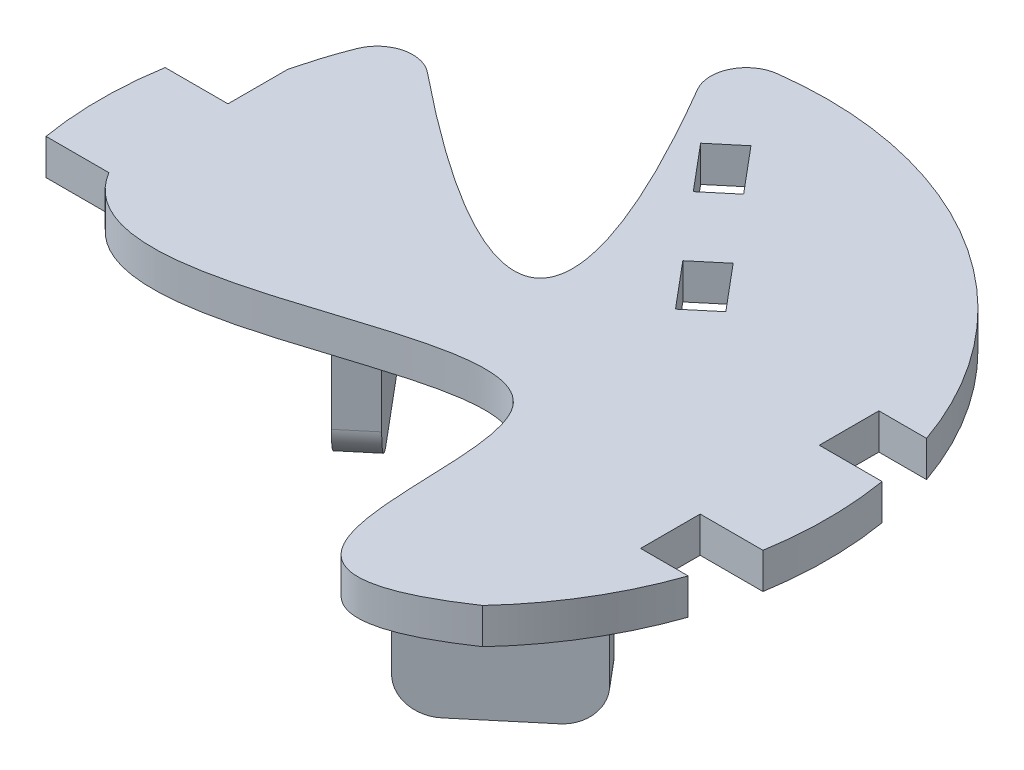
ISO-10303-21;
HEADER;
FILE_DESCRIPTION(('STEP AP214'),'2;1');
FILE_NAME('part.step','',(''),(''),'','','');
FILE_SCHEMA(('AUTOMOTIVE_DESIGN { 1 0 10303 214 1 1 1 1 }'));
ENDSEC;
DATA;
#1=APPLICATION_CONTEXT('core data for automotive mechanical design processes');
#2=APPLICATION_PROTOCOL_DEFINITION('international standard','automotive_design',2000,#1);
#3=PRODUCT_CONTEXT('',#1,'mechanical');
#4=PRODUCT('Part','Part','',(#3));
#5=PRODUCT_RELATED_PRODUCT_CATEGORY('part','',(#4));
#6=PRODUCT_DEFINITION_FORMATION('','',#4);
#7=PRODUCT_DEFINITION_CONTEXT('part definition',#1,'design');
#8=PRODUCT_DEFINITION('design','',#6,#7);
#9=PRODUCT_DEFINITION_SHAPE('','',#8);
#10=(LENGTH_UNIT() NAMED_UNIT(*) SI_UNIT(.MILLI.,.METRE.));
#11=(NAMED_UNIT(*) PLANE_ANGLE_UNIT() SI_UNIT($,.RADIAN.));
#12=(NAMED_UNIT(*) SI_UNIT($,.STERADIAN.) SOLID_ANGLE_UNIT());
#13=UNCERTAINTY_MEASURE_WITH_UNIT(LENGTH_MEASURE(1.E-05),#10,'distance_accuracy_value','');
#14=(GEOMETRIC_REPRESENTATION_CONTEXT(3) GLOBAL_UNCERTAINTY_ASSIGNED_CONTEXT((#13)) GLOBAL_UNIT_ASSIGNED_CONTEXT((#10,
#11,#12)) REPRESENTATION_CONTEXT('',''));
#15=CARTESIAN_POINT('',(0.,0.,0.));
#16=DIRECTION('',(0.,0.,1.));
#17=DIRECTION('',(1.,0.,0.));
#18=AXIS2_PLACEMENT_3D('',#15,#16,#17);
#19=CARTESIAN_POINT('',(0.,3.,0.));
#20=DIRECTION('',(0.,1.,0.));
#21=DIRECTION('',(0.,0.,1.));
#22=AXIS2_PLACEMENT_3D('',#19,#20,#21);
#23=PLANE('',#22);
#24=DIRECTION('',(-0.766044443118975,0.,0.642787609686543));
#25=VECTOR('',#24,1.);
#26=CARTESIAN_POINT('',(-3.90227068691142,3.,-4.65054511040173));
#27=LINE('',#26,#25);
#28=CARTESIAN_POINT('',(7.97141818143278,3.,-14.6137530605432));
#29=VERTEX_POINT('',#28);
#30=CARTESIAN_POINT('',(5.67328485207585,3.,-12.6853902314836));
#31=VERTEX_POINT('',#30);
#32=EDGE_CURVE('E1413',#29,#31,#27,.T.);
#33=ORIENTED_EDGE('',*,*,#32,.F.);
#34=DIRECTION('',(0.642787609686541,0.,0.766044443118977));
#35=VECTOR('',#34,1.);
#36=CARTESIAN_POINT('',(11.8736888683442,3.,-9.96320795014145));
#37=LINE('',#36,#35);
#38=CARTESIAN_POINT('',(11.1853562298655,3.,-10.7835308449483));
#39=VERTEX_POINT('',#38);
#40=EDGE_CURVE('E482',#29,#39,#37,.T.);
#41=ORIENTED_EDGE('',*,*,#40,.T.);
#42=DIRECTION('',(-0.766044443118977,0.,0.642787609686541));
#43=VECTOR('',#42,1.);
#44=CARTESIAN_POINT('',(-0.688332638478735,3.,-0.820322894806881));
#45=LINE('',#44,#43);
#46=CARTESIAN_POINT('',(8.88722290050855,3.,-8.8551680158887));
#47=VERTEX_POINT('',#46);
#48=EDGE_CURVE('E909',#39,#47,#45,.T.);
#49=ORIENTED_EDGE('',*,*,#48,.T.);
#50=DIRECTION('',(0.64278760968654,0.,0.766044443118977));
#51=VECTOR('',#50,1.);
#52=CARTESIAN_POINT('',(9.57555553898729,3.,-8.03484512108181));
#53=LINE('',#52,#51);
#54=EDGE_CURVE('E921',#31,#47,#53,.T.);
#55=ORIENTED_EDGE('',*,*,#54,.F.);
#56=EDGE_LOOP('',(#33,#41,#49,#55));
#57=FACE_BOUND('',#56,.T.);
#58=CARTESIAN_POINT('',(0.,3.,0.));
#59=DIRECTION('',(0.,1.,0.));
#60=DIRECTION('',(0.,0.,1.));
#61=AXIS2_PLACEMENT_3D('',#58,#59,#60);
#62=CIRCLE('',#61,30.5);
#63=CARTESIAN_POINT('',(28.8140590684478,3.,-10.));
#64=VERTEX_POINT('',#63);
#65=CARTESIAN_POINT('',(-3.95861769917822,3.,-30.2420129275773));
#66=VERTEX_POINT('',#65);
#67=EDGE_CURVE('E827',#64,#66,#62,.T.);
#68=ORIENTED_EDGE('',*,*,#67,.T.);
#69=CARTESIAN_POINT('',(-3.56924546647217,3.,-27.2673887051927));
#70=DIRECTION('',(0.,1.,0.));
#71=DIRECTION('',(0.,0.,1.));
#72=AXIS2_PLACEMENT_3D('',#69,#70,#71);
#73=CIRCLE('',#72,3.);
#74=CARTESIAN_POINT('',(-6.16007700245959,3.,-25.7549099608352));
#75=VERTEX_POINT('',#74);
#76=EDGE_CURVE('E723',#66,#75,#73,.T.);
#77=ORIENTED_EDGE('',*,*,#76,.T.);
#78=CARTESIAN_POINT('',(-18.7453208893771,3.,-15.6645535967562));
#79=CARTESIAN_POINT('',(3.8670009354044,3.,2.57649625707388));
#80=CARTESIAN_POINT('',(8.09424648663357,3.,-2.49637913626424));
#81=CARTESIAN_POINT('',(-8.30734565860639,3.,-29.3468568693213));
#82=B_SPLINE_CURVE_WITH_KNOTS('',3,(#78,#79,#80,#81),.UNSPECIFIED.,.F.,.F.,(4,4),
(0.0405275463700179,1.),.UNSPECIFIED.);
#83=CARTESIAN_POINT('',(-18.7453208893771,3.,-15.6645535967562));
#84=VERTEX_POINT('',#83);
#85=EDGE_CURVE('E988',#84,#75,#82,.T.);
#86=ORIENTED_EDGE('',*,*,#85,.F.);
#87=CARTESIAN_POINT('',(-20.6289102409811,3.,-13.3295822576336));
#88=DIRECTION('',(0.,1.,0.));
#89=DIRECTION('',(0.,0.,1.));
#90=AXIS2_PLACEMENT_3D('',#87,#88,#89);
#91=CIRCLE('',#90,3.);
#92=CARTESIAN_POINT('',(-23.4189051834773,3.,-14.4322736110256));
#93=VERTEX_POINT('',#92);
#94=EDGE_CURVE('E420',#93,#84,#91,.F.);
#95=ORIENTED_EDGE('',*,*,#94,.F.);
#96=CARTESIAN_POINT('',(-24.8140590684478,3.,5.));
#97=CARTESIAN_POINT('',(-26.3603422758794,3.,-1.58958445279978));
#98=CARTESIAN_POINT('',(-25.8362968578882,3.,-8.31586531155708));
#99=CARTESIAN_POINT('',(-23.4189051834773,3.,-14.4322736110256));
#100=B_SPLINE_CURVE_WITH_KNOTS('',3,(#96,#97,#98,#99),.UNSPECIFIED.,.F.,.F.,(4,4),(0.,
0.831813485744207),.UNSPECIFIED.);
#101=CARTESIAN_POINT('',(-24.8140590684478,3.,-10.));
#102=VERTEX_POINT('',#101);
#103=EDGE_CURVE('E1001',#102,#93,#100,.T.);
#104=ORIENTED_EDGE('',*,*,#103,.F.);
#105=DIRECTION('',(0.,0.,-1.));
#106=VECTOR('',#105,1.);
#107=CARTESIAN_POINT('',(-24.8140590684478,3.,0.));
#108=LINE('',#107,#106);
#109=CARTESIAN_POINT('',(-24.8140590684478,3.,-5.));
#110=VERTEX_POINT('',#109);
#111=EDGE_CURVE('E963',#110,#102,#108,.T.);
#112=ORIENTED_EDGE('',*,*,#111,.F.);
#113=DIRECTION('',(-1.,0.,0.));
#114=VECTOR('',#113,1.);
#115=CARTESIAN_POINT('',(0.,3.,-5.));
#116=LINE('',#115,#114);
#117=CARTESIAN_POINT('',(-30.0873727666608,3.,-5.));
#118=VERTEX_POINT('',#117);
#119=EDGE_CURVE('E960',#110,#118,#116,.T.);
#120=ORIENTED_EDGE('',*,*,#119,.T.);
#121=CARTESIAN_POINT('',(-30.0873727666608,3.,5.));
#122=VERTEX_POINT('',#121);
#123=EDGE_CURVE('E823',#118,#122,#62,.T.);
#124=ORIENTED_EDGE('',*,*,#123,.T.);
#125=DIRECTION('',(-1.,0.,0.));
#126=VECTOR('',#125,1.);
#127=CARTESIAN_POINT('',(0.,3.,5.00000000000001));
#128=LINE('',#127,#126);
#129=CARTESIAN_POINT('',(-24.8140590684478,3.,5.));
#130=VERTEX_POINT('',#129);
#131=EDGE_CURVE('E846',#130,#122,#128,.T.);
#132=ORIENTED_EDGE('',*,*,#131,.F.);
#133=CARTESIAN_POINT('',(22.3289408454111,3.,20.7766311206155));
#134=CARTESIAN_POINT('',(5.97375164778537,3.,31.8512079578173));
#135=CARTESIAN_POINT('',(22.176782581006,3.,-15.835204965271));
#136=CARTESIAN_POINT('',(-18.2068680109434,3.,15.8076452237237));
#137=CARTESIAN_POINT('',(-24.8140590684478,3.,5.));
#138=B_SPLINE_CURVE_WITH_KNOTS('',3,(#133,#134,#135,#136,#137),.UNSPECIFIED.,.F.,.F.,(4,1,4),
(0.,0.445790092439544,1.),.UNSPECIFIED.);
#139=CARTESIAN_POINT('',(22.3289408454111,3.,20.7766311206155));
#140=VERTEX_POINT('',#139);
#141=EDGE_CURVE('E466',#140,#130,#138,.T.);
#142=ORIENTED_EDGE('',*,*,#141,.F.);
#143=CARTESIAN_POINT('',(28.8140590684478,3.,10.));
#144=VERTEX_POINT('',#143);
#145=EDGE_CURVE('E829',#140,#144,#62,.T.);
#146=ORIENTED_EDGE('',*,*,#145,.T.);
#147=DIRECTION('',(1.,0.,0.));
#148=VECTOR('',#147,1.);
#149=CARTESIAN_POINT('',(0.,3.,10.));
#150=LINE('',#149,#148);
#151=CARTESIAN_POINT('',(24.8140590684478,3.,10.));
#152=VERTEX_POINT('',#151);
#153=EDGE_CURVE('E929',#152,#144,#150,.T.);
#154=ORIENTED_EDGE('',*,*,#153,.F.);
#155=DIRECTION('',(0.,0.,1.));
#156=VECTOR('',#155,1.);
#157=CARTESIAN_POINT('',(24.8140590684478,3.,0.));
#158=LINE('',#157,#156);
#159=CARTESIAN_POINT('',(24.8140590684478,3.,5.));
#160=VERTEX_POINT('',#159);
#161=EDGE_CURVE('E911',#160,#152,#158,.T.);
#162=ORIENTED_EDGE('',*,*,#161,.F.);
#163=DIRECTION('',(1.,0.,0.));
#164=VECTOR('',#163,1.);
#165=CARTESIAN_POINT('',(0.,3.,5.));
#166=LINE('',#165,#164);
#167=CARTESIAN_POINT('',(30.0873727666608,3.,5.));
#168=VERTEX_POINT('',#167);
#169=EDGE_CURVE('E932',#160,#168,#166,.T.);
#170=ORIENTED_EDGE('',*,*,#169,.T.);
#171=CARTESIAN_POINT('',(30.0873727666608,3.,-5.));
#172=VERTEX_POINT('',#171);
#173=EDGE_CURVE('E968',#168,#172,#62,.T.);
#174=ORIENTED_EDGE('',*,*,#173,.T.);
#175=DIRECTION('',(1.,0.,0.));
#176=VECTOR('',#175,1.);
#177=CARTESIAN_POINT('',(0.,3.,-5.00000000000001));
#178=LINE('',#177,#176);
#179=CARTESIAN_POINT('',(24.8140590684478,3.,-5.));
#180=VERTEX_POINT('',#179);
#181=EDGE_CURVE('E948',#180,#172,#178,.T.);
#182=ORIENTED_EDGE('',*,*,#181,.F.);
#183=DIRECTION('',(0.,0.,-1.));
#184=VECTOR('',#183,1.);
#185=CARTESIAN_POINT('',(24.8140590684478,3.,0.));
#186=LINE('',#185,#184);
#187=CARTESIAN_POINT('',(24.8140590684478,3.,-10.));
#188=VERTEX_POINT('',#187);
#189=EDGE_CURVE('E945',#180,#188,#186,.T.);
#190=ORIENTED_EDGE('',*,*,#189,.T.);
#191=DIRECTION('',(1.,0.,0.));
#192=VECTOR('',#191,1.);
#193=CARTESIAN_POINT('',(0.,3.,-10.));
#194=LINE('',#193,#192);
#195=EDGE_CURVE('E942',#188,#64,#194,.T.);
#196=ORIENTED_EDGE('',*,*,#195,.T.);
#197=EDGE_LOOP('',(#68,#77,#86,#95,#104,#112,#120,#124,#132,#142,#146,#154,#162,#170,#174,#182,
#190,#196));
#198=FACE_BOUND('',#197,.T.);
#199=DIRECTION('',(-0.766044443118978,0.,0.642787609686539));
#200=VECTOR('',#199,1.);
#201=CARTESIAN_POINT('',(-11.6960704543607,3.,-13.9388339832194));
#202=LINE('',#201,#200);
#203=CARTESIAN_POINT('',(0.177618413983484,3.,-23.9020419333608));
#204=VERTEX_POINT('',#203);
#205=CARTESIAN_POINT('',(-2.12051491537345,3.,-21.9736791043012));
#206=VERTEX_POINT('',#205);
#207=EDGE_CURVE('E405',#204,#206,#202,.T.);
#208=ORIENTED_EDGE('',*,*,#207,.F.);
#209=DIRECTION('',(0.64278760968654,0.,0.766044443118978));
#210=VECTOR('',#209,1.);
#211=CARTESIAN_POINT('',(11.8736888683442,3.,-9.96320795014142));
#212=LINE('',#211,#210);
#213=CARTESIAN_POINT('',(3.39155646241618,3.,-20.0718197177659));
#214=VERTEX_POINT('',#213);
#215=EDGE_CURVE('E410',#204,#214,#212,.T.);
#216=ORIENTED_EDGE('',*,*,#215,.T.);
#217=DIRECTION('',(-0.766044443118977,0.,0.642787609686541));
#218=VECTOR('',#217,1.);
#219=CARTESIAN_POINT('',(-8.48213240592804,3.,-10.1086117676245));
#220=LINE('',#219,#218);
#221=CARTESIAN_POINT('',(1.09342313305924,3.,-18.1434568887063));
#222=VERTEX_POINT('',#221);
#223=EDGE_CURVE('E413',#214,#222,#220,.T.);
#224=ORIENTED_EDGE('',*,*,#223,.T.);
#225=DIRECTION('',(0.64278760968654,0.,0.766044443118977));
#226=VECTOR('',#225,1.);
#227=CARTESIAN_POINT('',(9.57555553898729,3.,-8.03484512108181));
#228=LINE('',#227,#226);
#229=EDGE_CURVE('E394',#206,#222,#228,.T.);
#230=ORIENTED_EDGE('',*,*,#229,.F.);
#231=EDGE_LOOP('',(#208,#216,#224,#230));
#232=FACE_BOUND('',#231,.T.);
#233=ADVANCED_FACE('F109',(#57,#198,#232),#23,.T.);
#234=CARTESIAN_POINT('',(0.,0.,0.));
#235=DIRECTION('',(0.,1.,0.));
#236=DIRECTION('',(0.,0.,1.));
#237=AXIS2_PLACEMENT_3D('',#234,#235,#236);
#238=PLANE('',#237);
#239=DIRECTION('',(0.766044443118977,0.,-0.642787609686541));
#240=VECTOR('',#239,1.);
#241=CARTESIAN_POINT('',(-0.0455450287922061,0.,-0.0542784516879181));
#242=LINE('',#241,#240);
#243=CARTESIAN_POINT('',(-6.93994501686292,0.,5.73081003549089));
#244=VERTEX_POINT('',#243);
#245=CARTESIAN_POINT('',(-3.87576724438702,0.,3.15965959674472));
#246=VERTEX_POINT('',#245);
#247=EDGE_CURVE('E505',#244,#246,#242,.T.);
#248=ORIENTED_EDGE('',*,*,#247,.T.);
#249=DIRECTION('',(-0.642787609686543,0.,-0.766044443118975));
#250=VECTOR('',#249,1.);
#251=CARTESIAN_POINT('',(-3.8302222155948,0.,3.21393804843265));
#252=LINE('',#251,#250);
#253=CARTESIAN_POINT('',(-14.8031566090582,0.,-9.86309593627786));
#254=VERTEX_POINT('',#253);
#255=EDGE_CURVE('E716',#246,#254,#252,.T.);
#256=ORIENTED_EDGE('',*,*,#255,.T.);
#257=DIRECTION('',(-0.766044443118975,0.,0.642787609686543));
#258=VECTOR('',#257,1.);
#259=CARTESIAN_POINT('',(-10.9729343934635,0.,-13.0770339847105));
#260=LINE('',#259,#258);
#261=CARTESIAN_POINT('',(-17.8673343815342,0.,-7.29194549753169));
#262=VERTEX_POINT('',#261);
#263=EDGE_CURVE('E501',#254,#262,#260,.T.);
#264=ORIENTED_EDGE('',*,*,#263,.T.);
#265=DIRECTION('',(0.642787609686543,0.,0.766044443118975));
#266=VECTOR('',#265,1.);
#267=CARTESIAN_POINT('',(-6.8943999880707,0.,5.78508848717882));
#268=LINE('',#267,#266);
#269=EDGE_CURVE('E503',#262,#244,#268,.T.);
#270=ORIENTED_EDGE('',*,*,#269,.T.);
#271=EDGE_LOOP('',(#248,#256,#264,#270));
#272=FACE_BOUND('',#271,.T.);
#273=DIRECTION('',(0.642787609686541,0.,0.766044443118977));
#274=VECTOR('',#273,1.);
#275=CARTESIAN_POINT('',(11.8736888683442,0.,-9.96320795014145));
#276=LINE('',#275,#274);
#277=CARTESIAN_POINT('',(7.97141818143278,0.,-14.6137530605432));
#278=VERTEX_POINT('',#277);
#279=CARTESIAN_POINT('',(11.1853562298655,0.,-10.7835308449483));
#280=VERTEX_POINT('',#279);
#281=EDGE_CURVE('E850',#278,#280,#276,.T.);
#282=ORIENTED_EDGE('',*,*,#281,.F.);
#283=DIRECTION('',(-0.766044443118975,0.,0.642787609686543));
#284=VECTOR('',#283,1.);
#285=CARTESIAN_POINT('',(-3.90227068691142,0.,-4.65054511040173));
#286=LINE('',#285,#284);
#287=CARTESIAN_POINT('',(5.67328485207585,0.,-12.6853902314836));
#288=VERTEX_POINT('',#287);
#289=EDGE_CURVE('E889',#278,#288,#286,.T.);
#290=ORIENTED_EDGE('',*,*,#289,.T.);
#291=DIRECTION('',(0.64278760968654,0.,0.766044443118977));
#292=VECTOR('',#291,1.);
#293=CARTESIAN_POINT('',(9.57555553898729,0.,-8.03484512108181));
#294=LINE('',#293,#292);
#295=CARTESIAN_POINT('',(8.88722290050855,0.,-8.8551680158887));
#296=VERTEX_POINT('',#295);
#297=EDGE_CURVE('E892',#288,#296,#294,.T.);
#298=ORIENTED_EDGE('',*,*,#297,.T.);
#299=DIRECTION('',(-0.766044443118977,0.,0.642787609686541));
#300=VECTOR('',#299,1.);
#301=CARTESIAN_POINT('',(-0.688332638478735,0.,-0.820322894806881));
#302=LINE('',#301,#300);
#303=EDGE_CURVE('E894',#280,#296,#302,.T.);
#304=ORIENTED_EDGE('',*,*,#303,.F.);
#305=EDGE_LOOP('',(#282,#290,#298,#304));
#306=FACE_BOUND('',#305,.T.);
#307=DIRECTION('',(-0.766044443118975,0.,0.642787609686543));
#308=VECTOR('',#307,1.);
#309=CARTESIAN_POINT('',(13.2922978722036,0.,15.8411437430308));
#310=LINE('',#309,#308);
#311=CARTESIAN_POINT('',(22.2933200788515,0.,8.28838932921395));
#312=VERTEX_POINT('',#311);
#313=CARTESIAN_POINT('',(10.9553899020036,0.,17.8020423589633));
#314=VERTEX_POINT('',#313);
#315=EDGE_CURVE('E718',#312,#314,#310,.T.);
#316=ORIENTED_EDGE('',*,*,#315,.T.);
#317=CARTESIAN_POINT('',(22.3289408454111,0.,20.7766311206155));
#318=CARTESIAN_POINT('',(5.97375164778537,0.,31.8512079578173));
#319=CARTESIAN_POINT('',(22.176782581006,0.,-15.835204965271));
#320=CARTESIAN_POINT('',(-18.2068680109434,0.,15.8076452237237));
#321=CARTESIAN_POINT('',(-24.8140590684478,0.,5.));
#322=B_SPLINE_CURVE_WITH_KNOTS('',3,(#317,#318,#319,#320,#321),.UNSPECIFIED.,.F.,.F.,(4,1,4),
(0.,0.445790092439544,1.),.UNSPECIFIED.);
#323=CARTESIAN_POINT('',(-24.8140590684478,0.,5.));
#324=VERTEX_POINT('',#323);
#325=EDGE_CURVE('E478',#314,#324,#322,.T.);
#326=ORIENTED_EDGE('',*,*,#325,.T.);
#327=DIRECTION('',(-1.,0.,0.));
#328=VECTOR('',#327,1.);
#329=CARTESIAN_POINT('',(0.,0.,5.00000000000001));
#330=LINE('',#329,#328);
#331=CARTESIAN_POINT('',(-30.0873727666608,0.,5.));
#332=VERTEX_POINT('',#331);
#333=EDGE_CURVE('E854',#324,#332,#330,.T.);
#334=ORIENTED_EDGE('',*,*,#333,.T.);
#335=CARTESIAN_POINT('',(0.,0.,0.));
#336=DIRECTION('',(0.,1.,0.));
#337=DIRECTION('',(0.,0.,1.));
#338=AXIS2_PLACEMENT_3D('',#335,#336,#337);
#339=CIRCLE('',#338,30.5);
#340=CARTESIAN_POINT('',(-30.0873727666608,0.,-5.));
#341=VERTEX_POINT('',#340);
#342=EDGE_CURVE('E826',#341,#332,#339,.T.);
#343=ORIENTED_EDGE('',*,*,#342,.F.);
#344=DIRECTION('',(-1.,0.,0.));
#345=VECTOR('',#344,1.);
#346=CARTESIAN_POINT('',(0.,0.,-5.));
#347=LINE('',#346,#345);
#348=CARTESIAN_POINT('',(-24.8140590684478,0.,-5.));
#349=VERTEX_POINT('',#348);
#350=EDGE_CURVE('E869',#349,#341,#347,.T.);
#351=ORIENTED_EDGE('',*,*,#350,.F.);
#352=DIRECTION('',(0.,0.,-1.));
#353=VECTOR('',#352,1.);
#354=CARTESIAN_POINT('',(-24.8140590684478,0.,0.));
#355=LINE('',#354,#353);
#356=CARTESIAN_POINT('',(-24.8140590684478,0.,-10.));
#357=VERTEX_POINT('',#356);
#358=EDGE_CURVE('E857',#349,#357,#355,.T.);
#359=ORIENTED_EDGE('',*,*,#358,.T.);
#360=CARTESIAN_POINT('',(-24.8140590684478,0.,5.));
#361=CARTESIAN_POINT('',(-26.3603422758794,0.,-1.58958445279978));
#362=CARTESIAN_POINT('',(-25.8362968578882,0.,-8.31586531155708));
#363=CARTESIAN_POINT('',(-23.4189051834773,0.,-14.4322736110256));
#364=B_SPLINE_CURVE_WITH_KNOTS('',3,(#360,#361,#362,#363),.UNSPECIFIED.,.F.,.F.,(4,4),(0.,
0.831813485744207),.UNSPECIFIED.);
#365=CARTESIAN_POINT('',(-23.4189051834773,0.,-14.4322736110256));
#366=VERTEX_POINT('',#365);
#367=EDGE_CURVE('E989',#357,#366,#364,.T.);
#368=ORIENTED_EDGE('',*,*,#367,.T.);
#369=CARTESIAN_POINT('',(-20.6289102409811,0.,-13.3295822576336));
#370=DIRECTION('',(0.,1.,0.));
#371=DIRECTION('',(0.,0.,1.));
#372=AXIS2_PLACEMENT_3D('',#369,#370,#371);
#373=CIRCLE('',#372,3.);
#374=CARTESIAN_POINT('',(-18.7453208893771,0.,-15.6645535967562));
#375=VERTEX_POINT('',#374);
#376=EDGE_CURVE('E711',#366,#375,#373,.F.);
#377=ORIENTED_EDGE('',*,*,#376,.T.);
#378=CARTESIAN_POINT('',(-18.7453208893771,0.,-15.6645535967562));
#379=CARTESIAN_POINT('',(3.8670009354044,0.,2.57649625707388));
#380=CARTESIAN_POINT('',(8.09424648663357,0.,-2.49637913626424));
#381=CARTESIAN_POINT('',(-8.30734565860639,0.,-29.3468568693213));
#382=B_SPLINE_CURVE_WITH_KNOTS('',3,(#378,#379,#380,#381),.UNSPECIFIED.,.F.,.F.,(4,4),
(0.0405275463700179,1.),.UNSPECIFIED.);
#383=CARTESIAN_POINT('',(-6.16007700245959,0.,-25.7549099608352));
#384=VERTEX_POINT('',#383);
#385=EDGE_CURVE('E462',#375,#384,#382,.T.);
#386=ORIENTED_EDGE('',*,*,#385,.T.);
#387=CARTESIAN_POINT('',(-3.56924546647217,0.,-27.2673887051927));
#388=DIRECTION('',(0.,1.,0.));
#389=DIRECTION('',(0.,0.,1.));
#390=AXIS2_PLACEMENT_3D('',#387,#388,#389);
#391=CIRCLE('',#390,3.);
#392=CARTESIAN_POINT('',(-3.95861769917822,0.,-30.2420129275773));
#393=VERTEX_POINT('',#392);
#394=EDGE_CURVE('E727',#384,#393,#391,.F.);
#395=ORIENTED_EDGE('',*,*,#394,.T.);
#396=CARTESIAN_POINT('',(28.8140590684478,0.,-10.));
#397=VERTEX_POINT('',#396);
#398=EDGE_CURVE('E830',#397,#393,#339,.T.);
#399=ORIENTED_EDGE('',*,*,#398,.F.);
#400=DIRECTION('',(1.,0.,0.));
#401=VECTOR('',#400,1.);
#402=CARTESIAN_POINT('',(0.,0.,-10.));
#403=LINE('',#402,#401);
#404=CARTESIAN_POINT('',(24.8140590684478,0.,-10.));
#405=VERTEX_POINT('',#404);
#406=EDGE_CURVE('E958',#405,#397,#403,.T.);
#407=ORIENTED_EDGE('',*,*,#406,.F.);
#408=DIRECTION('',(0.,0.,-1.));
#409=VECTOR('',#408,1.);
#410=CARTESIAN_POINT('',(24.8140590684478,0.,0.));
#411=LINE('',#410,#409);
#412=CARTESIAN_POINT('',(24.8140590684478,0.,-5.));
#413=VERTEX_POINT('',#412);
#414=EDGE_CURVE('E881',#413,#405,#411,.T.);
#415=ORIENTED_EDGE('',*,*,#414,.F.);
#416=DIRECTION('',(1.,0.,0.));
#417=VECTOR('',#416,1.);
#418=CARTESIAN_POINT('',(0.,0.,-5.00000000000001));
#419=LINE('',#418,#417);
#420=CARTESIAN_POINT('',(30.0873727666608,0.,-5.));
#421=VERTEX_POINT('',#420);
#422=EDGE_CURVE('E954',#413,#421,#419,.T.);
#423=ORIENTED_EDGE('',*,*,#422,.T.);
#424=CARTESIAN_POINT('',(30.0873727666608,0.,5.));
#425=VERTEX_POINT('',#424);
#426=EDGE_CURVE('E824',#425,#421,#339,.T.);
#427=ORIENTED_EDGE('',*,*,#426,.F.);
#428=DIRECTION('',(1.,0.,0.));
#429=VECTOR('',#428,1.);
#430=CARTESIAN_POINT('',(0.,0.,5.));
#431=LINE('',#430,#429);
#432=CARTESIAN_POINT('',(24.8140590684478,0.,5.));
#433=VERTEX_POINT('',#432);
#434=EDGE_CURVE('E940',#433,#425,#431,.T.);
#435=ORIENTED_EDGE('',*,*,#434,.F.);
#436=DIRECTION('',(0.,0.,1.));
#437=VECTOR('',#436,1.);
#438=CARTESIAN_POINT('',(24.8140590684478,0.,0.));
#439=LINE('',#438,#437);
#440=CARTESIAN_POINT('',(24.8140590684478,0.,10.));
#441=VERTEX_POINT('',#440);
#442=EDGE_CURVE('E887',#433,#441,#439,.T.);
#443=ORIENTED_EDGE('',*,*,#442,.T.);
#444=DIRECTION('',(1.,0.,0.));
#445=VECTOR('',#444,1.);
#446=CARTESIAN_POINT('',(0.,0.,10.));
#447=LINE('',#446,#445);
#448=CARTESIAN_POINT('',(28.8140590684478,0.,10.));
#449=VERTEX_POINT('',#448);
#450=EDGE_CURVE('E820',#441,#449,#447,.T.);
#451=ORIENTED_EDGE('',*,*,#450,.T.);
#452=CARTESIAN_POINT('',(22.3289408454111,0.,20.7766311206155));
#453=VERTEX_POINT('',#452);
#454=EDGE_CURVE('E818',#453,#449,#339,.T.);
#455=ORIENTED_EDGE('',*,*,#454,.F.);
#456=CARTESIAN_POINT('',(10.9928214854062,0.,18.1568369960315));
#457=VERTEX_POINT('',#456);
#458=EDGE_CURVE('E479',#453,#457,#322,.T.);
#459=ORIENTED_EDGE('',*,*,#458,.T.);
#460=DIRECTION('',(0.642787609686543,0.,0.766044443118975));
#461=VECTOR('',#460,1.);
#462=CARTESIAN_POINT('',(-2.48964444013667,0.,2.08905973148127));
#463=LINE('',#462,#461);
#464=CARTESIAN_POINT('',(13.3738038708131,0.,20.994381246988));
#465=VERTEX_POINT('',#464);
#466=EDGE_CURVE('E513',#457,#465,#463,.T.);
#467=ORIENTED_EDGE('',*,*,#466,.T.);
#468=DIRECTION('',(0.766044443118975,0.,-0.642787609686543));
#469=VECTOR('',#468,1.);
#470=CARTESIAN_POINT('',(15.8634483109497,0.,18.9053215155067));
#471=LINE('',#470,#469);
#472=CARTESIAN_POINT('',(24.8644705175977,0.,11.3525671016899));
#473=VERTEX_POINT('',#472);
#474=EDGE_CURVE('E508',#465,#473,#471,.T.);
#475=ORIENTED_EDGE('',*,*,#474,.T.);
#476=DIRECTION('',(-0.642787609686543,0.,-0.766044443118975));
#477=VECTOR('',#476,1.);
#478=CARTESIAN_POINT('',(9.00102220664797,0.,-7.55275441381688));
#479=LINE('',#478,#477);
#480=EDGE_CURVE('E510',#473,#312,#479,.T.);
#481=ORIENTED_EDGE('',*,*,#480,.T.);
#482=EDGE_LOOP('',(#316,#326,#334,#343,#351,#359,#368,#377,#386,#395,#399,#407,#415,#423,#427,
#435,#443,#451,#455,#459,#467,#475,#481));
#483=FACE_BOUND('',#482,.T.);
#484=DIRECTION('',(0.64278760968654,0.,0.766044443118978));
#485=VECTOR('',#484,1.);
#486=CARTESIAN_POINT('',(11.8736888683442,0.,-9.96320795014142));
#487=LINE('',#486,#485);
#488=CARTESIAN_POINT('',(0.177618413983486,0.,-23.9020419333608));
#489=VERTEX_POINT('',#488);
#490=CARTESIAN_POINT('',(3.39155646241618,0.,-20.0718197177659));
#491=VERTEX_POINT('',#490);
#492=EDGE_CURVE('E702',#489,#491,#487,.T.);
#493=ORIENTED_EDGE('',*,*,#492,.F.);
#494=DIRECTION('',(-0.766044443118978,0.,0.642787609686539));
#495=VECTOR('',#494,1.);
#496=CARTESIAN_POINT('',(-11.6960704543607,0.,-13.9388339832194));
#497=LINE('',#496,#495);
#498=CARTESIAN_POINT('',(-2.12051491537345,0.,-21.9736791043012));
#499=VERTEX_POINT('',#498);
#500=EDGE_CURVE('E708',#489,#499,#497,.T.);
#501=ORIENTED_EDGE('',*,*,#500,.T.);
#502=DIRECTION('',(0.64278760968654,0.,0.766044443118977));
#503=VECTOR('',#502,1.);
#504=CARTESIAN_POINT('',(9.57555553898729,0.,-8.03484512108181));
#505=LINE('',#504,#503);
#506=CARTESIAN_POINT('',(1.09342313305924,0.,-18.1434568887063));
#507=VERTEX_POINT('',#506);
#508=EDGE_CURVE('E397',#499,#507,#505,.T.);
#509=ORIENTED_EDGE('',*,*,#508,.T.);
#510=DIRECTION('',(-0.766044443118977,0.,0.642787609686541));
#511=VECTOR('',#510,1.);
#512=CARTESIAN_POINT('',(-8.48213240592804,0.,-10.1086117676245));
#513=LINE('',#512,#511);
#514=EDGE_CURVE('E706',#491,#507,#513,.T.);
#515=ORIENTED_EDGE('',*,*,#514,.F.);
#516=EDGE_LOOP('',(#493,#501,#509,#515));
#517=FACE_BOUND('',#516,.T.);
#518=ADVANCED_FACE('F600',(#272,#306,#483,#517),#238,.F.);
#519=CARTESIAN_POINT('',(0.,3.,0.));
#520=DIRECTION('',(0.,-1.,0.));
#521=DIRECTION('',(0.,0.,-1.));
#522=AXIS2_PLACEMENT_3D('',#519,#520,#521);
#523=CYLINDRICAL_SURFACE('',#522,30.5);
#524=DIRECTION('',(0.,-1.,0.));
#525=VECTOR('',#524,1.);
#526=CARTESIAN_POINT('',(30.0873727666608,3.,5.));
#527=LINE('',#526,#525);
#528=EDGE_CURVE('E885',#425,#168,#527,.F.);
#529=ORIENTED_EDGE('',*,*,#528,.F.);
#530=ORIENTED_EDGE('',*,*,#426,.T.);
#531=DIRECTION('',(0.,-1.,0.));
#532=VECTOR('',#531,1.);
#533=CARTESIAN_POINT('',(30.0873727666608,3.,-5.));
#534=LINE('',#533,#532);
#535=EDGE_CURVE('E873',#421,#172,#534,.F.);
#536=ORIENTED_EDGE('',*,*,#535,.T.);
#537=ORIENTED_EDGE('',*,*,#173,.F.);
#538=EDGE_LOOP('',(#529,#530,#536,#537));
#539=FACE_BOUND('',#538,.T.);
#540=ADVANCED_FACE('F606',(#539),#523,.T.);
#541=ORIENTED_EDGE('',*,*,#398,.T.);
#542=DIRECTION('',(0.,-1.,0.));
#543=VECTOR('',#542,1.);
#544=CARTESIAN_POINT('',(-3.95861769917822,3.,-30.2420129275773));
#545=LINE('',#544,#543);
#546=EDGE_CURVE('E720',#393,#66,#545,.F.);
#547=ORIENTED_EDGE('',*,*,#546,.T.);
#548=ORIENTED_EDGE('',*,*,#67,.F.);
#549=DIRECTION('',(0.,-1.,0.));
#550=VECTOR('',#549,1.);
#551=CARTESIAN_POINT('',(28.8140590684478,3.,-10.));
#552=LINE('',#551,#550);
#553=EDGE_CURVE('E877',#397,#64,#552,.F.);
#554=ORIENTED_EDGE('',*,*,#553,.F.);
#555=EDGE_LOOP('',(#541,#547,#548,#554));
#556=FACE_BOUND('',#555,.T.);
#557=ADVANCED_FACE('F981',(#556),#523,.T.);
#558=DIRECTION('',(0.,1.,0.));
#559=VECTOR('',#558,1.);
#560=CARTESIAN_POINT('',(-30.0873727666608,-1.,-5.));
#561=LINE('',#560,#559);
#562=EDGE_CURVE('E864',#341,#118,#561,.T.);
#563=ORIENTED_EDGE('',*,*,#562,.F.);
#564=ORIENTED_EDGE('',*,*,#342,.T.);
#565=DIRECTION('',(0.,1.,0.));
#566=VECTOR('',#565,1.);
#567=CARTESIAN_POINT('',(-30.0873727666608,-1.,5.));
#568=LINE('',#567,#566);
#569=EDGE_CURVE('E840',#332,#122,#568,.T.);
#570=ORIENTED_EDGE('',*,*,#569,.T.);
#571=ORIENTED_EDGE('',*,*,#123,.F.);
#572=EDGE_LOOP('',(#563,#564,#570,#571));
#573=FACE_BOUND('',#572,.T.);
#574=ADVANCED_FACE('F618',(#573),#523,.T.);
#575=ORIENTED_EDGE('',*,*,#145,.F.);
#576=DIRECTION('',(0.,1.,0.));
#577=VECTOR('',#576,1.);
#578=CARTESIAN_POINT('',(22.3289408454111,-7.,20.7766311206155));
#579=LINE('',#578,#577);
#580=EDGE_CURVE('E473',#453,#140,#579,.T.);
#581=ORIENTED_EDGE('',*,*,#580,.F.);
#582=ORIENTED_EDGE('',*,*,#454,.T.);
#583=DIRECTION('',(0.,-1.,0.));
#584=VECTOR('',#583,1.);
#585=CARTESIAN_POINT('',(28.8140590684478,3.,10.));
#586=LINE('',#585,#584);
#587=EDGE_CURVE('E883',#449,#144,#586,.F.);
#588=ORIENTED_EDGE('',*,*,#587,.T.);
#589=EDGE_LOOP('',(#575,#581,#582,#588));
#590=FACE_BOUND('',#589,.T.);
#591=ADVANCED_FACE('F615',(#590),#523,.T.);
#592=CARTESIAN_POINT('',(0.,-1.,5.00000000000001));
#593=DIRECTION('',(0.,0.,-1.));
#594=DIRECTION('',(-1.,0.,0.));
#595=AXIS2_PLACEMENT_3D('',#592,#593,#594);
#596=PLANE('',#595);
#597=DIRECTION('',(0.,1.,0.));
#598=VECTOR('',#597,1.);
#599=CARTESIAN_POINT('',(-24.8140590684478,-1.,5.));
#600=LINE('',#599,#598);
#601=EDGE_CURVE('E832',#324,#130,#600,.T.);
#602=ORIENTED_EDGE('',*,*,#601,.T.);
#603=ORIENTED_EDGE('',*,*,#131,.T.);
#604=ORIENTED_EDGE('',*,*,#569,.F.);
#605=ORIENTED_EDGE('',*,*,#333,.F.);
#606=EDGE_LOOP('',(#602,#603,#604,#605));
#607=FACE_BOUND('',#606,.T.);
#608=ADVANCED_FACE('F611',(#607),#596,.F.);
#609=CARTESIAN_POINT('',(0.,-1.,-5.));
#610=DIRECTION('',(0.,0.,-1.));
#611=DIRECTION('',(-1.,0.,0.));
#612=AXIS2_PLACEMENT_3D('',#609,#610,#611);
#613=PLANE('',#612);
#614=ORIENTED_EDGE('',*,*,#350,.T.);
#615=ORIENTED_EDGE('',*,*,#562,.T.);
#616=ORIENTED_EDGE('',*,*,#119,.F.);
#617=DIRECTION('',(0.,1.,0.));
#618=VECTOR('',#617,1.);
#619=CARTESIAN_POINT('',(-24.8140590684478,-1.,-5.));
#620=LINE('',#619,#618);
#621=EDGE_CURVE('E865',#349,#110,#620,.T.);
#622=ORIENTED_EDGE('',*,*,#621,.F.);
#623=EDGE_LOOP('',(#614,#615,#616,#622));
#624=FACE_BOUND('',#623,.T.);
#625=ADVANCED_FACE('F1025',(#624),#613,.T.);
#626=CARTESIAN_POINT('',(-24.8140590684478,-1.,0.));
#627=DIRECTION('',(1.,0.,0.));
#628=DIRECTION('',(0.,0.,-1.));
#629=AXIS2_PLACEMENT_3D('',#626,#627,#628);
#630=PLANE('',#629);
#631=ORIENTED_EDGE('',*,*,#621,.T.);
#632=ORIENTED_EDGE('',*,*,#111,.T.);
#633=DIRECTION('',(0.,1.,0.));
#634=VECTOR('',#633,1.);
#635=CARTESIAN_POINT('',(-24.8140590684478,-1.,-10.));
#636=LINE('',#635,#634);
#637=EDGE_CURVE('E862',#357,#102,#636,.T.);
#638=ORIENTED_EDGE('',*,*,#637,.F.);
#639=ORIENTED_EDGE('',*,*,#358,.F.);
#640=EDGE_LOOP('',(#631,#632,#638,#639));
#641=FACE_BOUND('',#640,.T.);
#642=ADVANCED_FACE('F1023',(#641),#630,.F.);
#643=CARTESIAN_POINT('',(24.8140590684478,-1.,0.));
#644=DIRECTION('',(1.,0.,0.));
#645=DIRECTION('',(0.,0.,-1.));
#646=AXIS2_PLACEMENT_3D('',#643,#644,#645);
#647=PLANE('',#646);
#648=ORIENTED_EDGE('',*,*,#414,.T.);
#649=DIRECTION('',(0.,1.,0.));
#650=VECTOR('',#649,1.);
#651=CARTESIAN_POINT('',(24.8140590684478,-1.,-10.));
#652=LINE('',#651,#650);
#653=EDGE_CURVE('E951',#405,#188,#652,.T.);
#654=ORIENTED_EDGE('',*,*,#653,.T.);
#655=ORIENTED_EDGE('',*,*,#189,.F.);
#656=DIRECTION('',(0.,1.,0.));
#657=VECTOR('',#656,1.);
#658=CARTESIAN_POINT('',(24.8140590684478,-1.,-5.));
#659=LINE('',#658,#657);
#660=EDGE_CURVE('E952',#413,#180,#659,.T.);
#661=ORIENTED_EDGE('',*,*,#660,.F.);
#662=EDGE_LOOP('',(#648,#654,#655,#661));
#663=FACE_BOUND('',#662,.T.);
#664=ADVANCED_FACE('F1049',(#663),#647,.T.);
#665=CARTESIAN_POINT('',(0.,-1.,-10.));
#666=DIRECTION('',(0.,0.,1.));
#667=DIRECTION('',(1.,0.,0.));
#668=AXIS2_PLACEMENT_3D('',#665,#666,#667);
#669=PLANE('',#668);
#670=ORIENTED_EDGE('',*,*,#406,.T.);
#671=ORIENTED_EDGE('',*,*,#553,.T.);
#672=ORIENTED_EDGE('',*,*,#195,.F.);
#673=ORIENTED_EDGE('',*,*,#653,.F.);
#674=EDGE_LOOP('',(#670,#671,#672,#673));
#675=FACE_BOUND('',#674,.T.);
#676=ADVANCED_FACE('F1052',(#675),#669,.T.);
#677=CARTESIAN_POINT('',(0.,-1.,-5.00000000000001));
#678=DIRECTION('',(0.,0.,1.));
#679=DIRECTION('',(1.,0.,0.));
#680=AXIS2_PLACEMENT_3D('',#677,#678,#679);
#681=PLANE('',#680);
#682=ORIENTED_EDGE('',*,*,#660,.T.);
#683=ORIENTED_EDGE('',*,*,#181,.T.);
#684=ORIENTED_EDGE('',*,*,#535,.F.);
#685=ORIENTED_EDGE('',*,*,#422,.F.);
#686=EDGE_LOOP('',(#682,#683,#684,#685));
#687=FACE_BOUND('',#686,.T.);
#688=ADVANCED_FACE('F1046',(#687),#681,.F.);
#689=CARTESIAN_POINT('',(24.8140590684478,-1.,0.));
#690=DIRECTION('',(-1.,0.,0.));
#691=DIRECTION('',(0.,0.,1.));
#692=AXIS2_PLACEMENT_3D('',#689,#690,#691);
#693=PLANE('',#692);
#694=DIRECTION('',(0.,1.,0.));
#695=VECTOR('',#694,1.);
#696=CARTESIAN_POINT('',(24.8140590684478,-1.,5.));
#697=LINE('',#696,#695);
#698=EDGE_CURVE('E936',#433,#160,#697,.T.);
#699=ORIENTED_EDGE('',*,*,#698,.T.);
#700=ORIENTED_EDGE('',*,*,#161,.T.);
#701=DIRECTION('',(0.,1.,0.));
#702=VECTOR('',#701,1.);
#703=CARTESIAN_POINT('',(24.8140590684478,-1.,10.));
#704=LINE('',#703,#702);
#705=EDGE_CURVE('E935',#441,#152,#704,.T.);
#706=ORIENTED_EDGE('',*,*,#705,.F.);
#707=ORIENTED_EDGE('',*,*,#442,.F.);
#708=EDGE_LOOP('',(#699,#700,#706,#707));
#709=FACE_BOUND('',#708,.T.);
#710=ADVANCED_FACE('F1033',(#709),#693,.F.);
#711=CARTESIAN_POINT('',(0.,-1.,5.));
#712=DIRECTION('',(0.,0.,1.));
#713=DIRECTION('',(1.,0.,0.));
#714=AXIS2_PLACEMENT_3D('',#711,#712,#713);
#715=PLANE('',#714);
#716=ORIENTED_EDGE('',*,*,#434,.T.);
#717=ORIENTED_EDGE('',*,*,#528,.T.);
#718=ORIENTED_EDGE('',*,*,#169,.F.);
#719=ORIENTED_EDGE('',*,*,#698,.F.);
#720=EDGE_LOOP('',(#716,#717,#718,#719));
#721=FACE_BOUND('',#720,.T.);
#722=ADVANCED_FACE('F1037',(#721),#715,.T.);
#723=CARTESIAN_POINT('',(0.,-1.,10.));
#724=DIRECTION('',(0.,0.,1.));
#725=DIRECTION('',(1.,0.,0.));
#726=AXIS2_PLACEMENT_3D('',#723,#724,#725);
#727=PLANE('',#726);
#728=ORIENTED_EDGE('',*,*,#705,.T.);
#729=ORIENTED_EDGE('',*,*,#153,.T.);
#730=ORIENTED_EDGE('',*,*,#587,.F.);
#731=ORIENTED_EDGE('',*,*,#450,.F.);
#732=EDGE_LOOP('',(#728,#729,#730,#731));
#733=FACE_BOUND('',#732,.T.);
#734=ADVANCED_FACE('F1028',(#733),#727,.F.);
#735=CARTESIAN_POINT('',(11.8736888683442,-7.,-9.96320795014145));
#736=DIRECTION('',(-0.766044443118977,0.,0.642787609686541));
#737=DIRECTION('',(0.642787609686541,0.,0.766044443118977));
#738=AXIS2_PLACEMENT_3D('',#735,#736,#737);
#739=PLANE('',#738);
#740=ORIENTED_EDGE('',*,*,#281,.T.);
#741=DIRECTION('',(0.,1.,0.));
#742=VECTOR('',#741,1.);
#743=CARTESIAN_POINT('',(11.1853562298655,-7.,-10.7835308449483));
#744=LINE('',#743,#742);
#745=EDGE_CURVE('E903',#280,#39,#744,.T.);
#746=ORIENTED_EDGE('',*,*,#745,.T.);
#747=ORIENTED_EDGE('',*,*,#40,.F.);
#748=DIRECTION('',(0.,1.,0.));
#749=VECTOR('',#748,1.);
#750=CARTESIAN_POINT('',(7.97141818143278,-7.,-14.6137530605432));
#751=LINE('',#750,#749);
#752=EDGE_CURVE('E906',#278,#29,#751,.T.);
#753=ORIENTED_EDGE('',*,*,#752,.F.);
#754=EDGE_LOOP('',(#740,#746,#747,#753));
#755=FACE_BOUND('',#754,.T.);
#756=ADVANCED_FACE('F902',(#755),#739,.T.);
#757=CARTESIAN_POINT('',(-0.688332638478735,-7.,-0.820322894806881));
#758=DIRECTION('',(-0.642787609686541,0.,-0.766044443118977));
#759=DIRECTION('',(-0.766044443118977,0.,0.642787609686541));
#760=AXIS2_PLACEMENT_3D('',#757,#758,#759);
#761=PLANE('',#760);
#762=ORIENTED_EDGE('',*,*,#303,.T.);
#763=DIRECTION('',(0.,1.,0.));
#764=VECTOR('',#763,1.);
#765=CARTESIAN_POINT('',(8.88722290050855,-7.,-8.8551680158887));
#766=LINE('',#765,#764);
#767=EDGE_CURVE('E912',#296,#47,#766,.T.);
#768=ORIENTED_EDGE('',*,*,#767,.T.);
#769=ORIENTED_EDGE('',*,*,#48,.F.);
#770=ORIENTED_EDGE('',*,*,#745,.F.);
#771=EDGE_LOOP('',(#762,#768,#769,#770));
#772=FACE_BOUND('',#771,.T.);
#773=ADVANCED_FACE('F453',(#772),#761,.T.);
#774=CARTESIAN_POINT('',(9.57555553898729,-7.,-8.03484512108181));
#775=DIRECTION('',(-0.766044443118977,0.,0.64278760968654));
#776=DIRECTION('',(0.64278760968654,0.,0.766044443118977));
#777=AXIS2_PLACEMENT_3D('',#774,#775,#776);
#778=PLANE('',#777);
#779=DIRECTION('',(0.,1.,0.));
#780=VECTOR('',#779,1.);
#781=CARTESIAN_POINT('',(5.67328485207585,-7.,-12.6853902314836));
#782=LINE('',#781,#780);
#783=EDGE_CURVE('E918',#288,#31,#782,.T.);
#784=ORIENTED_EDGE('',*,*,#783,.T.);
#785=ORIENTED_EDGE('',*,*,#54,.T.);
#786=ORIENTED_EDGE('',*,*,#767,.F.);
#787=ORIENTED_EDGE('',*,*,#297,.F.);
#788=EDGE_LOOP('',(#784,#785,#786,#787));
#789=FACE_BOUND('',#788,.T.);
#790=ADVANCED_FACE('F916',(#789),#778,.F.);
#791=CARTESIAN_POINT('',(-3.90227068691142,-7.,-4.65054511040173));
#792=DIRECTION('',(-0.642787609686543,0.,-0.766044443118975));
#793=DIRECTION('',(-0.766044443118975,0.,0.642787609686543));
#794=AXIS2_PLACEMENT_3D('',#791,#792,#793);
#795=PLANE('',#794);
#796=ORIENTED_EDGE('',*,*,#752,.T.);
#797=ORIENTED_EDGE('',*,*,#32,.T.);
#798=ORIENTED_EDGE('',*,*,#783,.F.);
#799=ORIENTED_EDGE('',*,*,#289,.F.);
#800=EDGE_LOOP('',(#796,#797,#798,#799));
#801=FACE_BOUND('',#800,.T.);
#802=ADVANCED_FACE('F451',(#801),#795,.F.);
#803=CARTESIAN_POINT('',(22.3289408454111,-7.,20.7766311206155));
#804=CARTESIAN_POINT('',(5.97375164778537,-7.,31.8512079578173));
#805=CARTESIAN_POINT('',(22.176782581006,-7.,-15.835204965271));
#806=CARTESIAN_POINT('',(-18.2068680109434,-7.,15.8076452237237));
#807=CARTESIAN_POINT('',(-24.8140590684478,-7.,5.));
#808=B_SPLINE_CURVE_WITH_KNOTS('',3,(#803,#804,#805,#806,#807),.UNSPECIFIED.,.F.,.F.,(4,1,4),
(0.,0.445790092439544,1.),.UNSPECIFIED.);
#809=DIRECTION('',(0.,1.,0.));
#810=VECTOR('',#809,1.);
#811=SURFACE_OF_LINEAR_EXTRUSION('',#808,#810);
#812=ORIENTED_EDGE('',*,*,#580,.T.);
#813=ORIENTED_EDGE('',*,*,#141,.T.);
#814=ORIENTED_EDGE('',*,*,#601,.F.);
#815=ORIENTED_EDGE('',*,*,#325,.F.);
#816=EDGE_CURVE('E483',#457,#314,#322,.T.);
#817=ORIENTED_EDGE('',*,*,#816,.F.);
#818=ORIENTED_EDGE('',*,*,#458,.F.);
#819=EDGE_LOOP('',(#812,#813,#814,#815,#817,#818));
#820=FACE_BOUND('',#819,.T.);
#821=ADVANCED_FACE('F445',(#820),#811,.F.);
#822=CARTESIAN_POINT('',(-20.6289102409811,-7.,-13.3295822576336));
#823=DIRECTION('',(0.,1.,0.));
#824=DIRECTION('',(0.,0.,1.));
#825=AXIS2_PLACEMENT_3D('',#822,#823,#824);
#826=CYLINDRICAL_SURFACE('',#825,3.);
#827=DIRECTION('',(0.,1.,0.));
#828=VECTOR('',#827,1.);
#829=CARTESIAN_POINT('',(-23.4189051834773,-7.,-14.4322736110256));
#830=LINE('',#829,#828);
#831=EDGE_CURVE('E990',#366,#93,#830,.T.);
#832=ORIENTED_EDGE('',*,*,#831,.T.);
#833=ORIENTED_EDGE('',*,*,#94,.T.);
#834=DIRECTION('',(0.,1.,0.));
#835=VECTOR('',#834,1.);
#836=CARTESIAN_POINT('',(-18.7453208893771,-7.,-15.6645535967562));
#837=LINE('',#836,#835);
#838=EDGE_CURVE('E992',#375,#84,#837,.T.);
#839=ORIENTED_EDGE('',*,*,#838,.F.);
#840=ORIENTED_EDGE('',*,*,#376,.F.);
#841=EDGE_LOOP('',(#832,#833,#839,#840));
#842=FACE_BOUND('',#841,.T.);
#843=ADVANCED_FACE('F440',(#842),#826,.T.);
#844=CARTESIAN_POINT('',(-18.7453208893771,-7.,-15.6645535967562));
#845=CARTESIAN_POINT('',(3.8670009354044,-7.,2.57649625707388));
#846=CARTESIAN_POINT('',(8.09424648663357,-7.,-2.49637913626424));
#847=CARTESIAN_POINT('',(-8.30734565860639,-7.,-29.3468568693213));
#848=B_SPLINE_CURVE_WITH_KNOTS('',3,(#844,#845,#846,#847),.UNSPECIFIED.,.F.,.F.,(4,4),
(0.0405275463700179,1.),.UNSPECIFIED.);
#849=DIRECTION('',(0.,1.,0.));
#850=VECTOR('',#849,1.);
#851=SURFACE_OF_LINEAR_EXTRUSION('',#848,#850);
#852=ORIENTED_EDGE('',*,*,#85,.T.);
#853=DIRECTION('',(0.,1.,0.));
#854=VECTOR('',#853,1.);
#855=CARTESIAN_POINT('',(-6.16007700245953,3.,-25.7549099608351));
#856=LINE('',#855,#854);
#857=EDGE_CURVE('E725',#75,#384,#856,.F.);
#858=ORIENTED_EDGE('',*,*,#857,.T.);
#859=ORIENTED_EDGE('',*,*,#385,.F.);
#860=ORIENTED_EDGE('',*,*,#838,.T.);
#861=EDGE_LOOP('',(#852,#858,#859,#860));
#862=FACE_BOUND('',#861,.T.);
#863=ADVANCED_FACE('F435',(#862),#851,.F.);
#864=CARTESIAN_POINT('',(-24.8140590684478,-7.,5.));
#865=CARTESIAN_POINT('',(-26.3603422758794,-7.,-1.58958445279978));
#866=CARTESIAN_POINT('',(-25.8362968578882,-7.,-8.31586531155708));
#867=CARTESIAN_POINT('',(-23.4189051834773,-7.,-14.4322736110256));
#868=B_SPLINE_CURVE_WITH_KNOTS('',3,(#864,#865,#866,#867),.UNSPECIFIED.,.F.,.F.,(4,4),(0.,
0.831813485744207),.UNSPECIFIED.);
#869=DIRECTION('',(0.,1.,0.));
#870=VECTOR('',#869,1.);
#871=SURFACE_OF_LINEAR_EXTRUSION('',#868,#870);
#872=ORIENTED_EDGE('',*,*,#637,.T.);
#873=ORIENTED_EDGE('',*,*,#103,.T.);
#874=ORIENTED_EDGE('',*,*,#831,.F.);
#875=ORIENTED_EDGE('',*,*,#367,.F.);
#876=EDGE_LOOP('',(#872,#873,#874,#875));
#877=FACE_BOUND('',#876,.T.);
#878=ADVANCED_FACE('F439',(#877),#871,.F.);
#879=CARTESIAN_POINT('',(11.8736888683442,-7.,-9.96320795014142));
#880=DIRECTION('',(-0.766044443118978,0.,0.64278760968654));
#881=DIRECTION('',(0.64278760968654,0.,0.766044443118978));
#882=AXIS2_PLACEMENT_3D('',#879,#880,#881);
#883=PLANE('',#882);
#884=ORIENTED_EDGE('',*,*,#492,.T.);
#885=DIRECTION('',(0.,1.,0.));
#886=VECTOR('',#885,1.);
#887=CARTESIAN_POINT('',(3.39155646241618,-7.,-20.0718197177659));
#888=LINE('',#887,#886);
#889=EDGE_CURVE('E418',#491,#214,#888,.T.);
#890=ORIENTED_EDGE('',*,*,#889,.T.);
#891=ORIENTED_EDGE('',*,*,#215,.F.);
#892=DIRECTION('',(0.,1.,0.));
#893=VECTOR('',#892,1.);
#894=CARTESIAN_POINT('',(0.177618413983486,-7.,-23.9020419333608));
#895=LINE('',#894,#893);
#896=EDGE_CURVE('E401',#489,#204,#895,.T.);
#897=ORIENTED_EDGE('',*,*,#896,.F.);
#898=EDGE_LOOP('',(#884,#890,#891,#897));
#899=FACE_BOUND('',#898,.T.);
#900=ADVANCED_FACE('F699',(#899),#883,.T.);
#901=CARTESIAN_POINT('',(-8.48213240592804,-7.,-10.1086117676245));
#902=DIRECTION('',(-0.642787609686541,0.,-0.766044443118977));
#903=DIRECTION('',(-0.766044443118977,0.,0.642787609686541));
#904=AXIS2_PLACEMENT_3D('',#901,#902,#903);
#905=PLANE('',#904);
#906=ORIENTED_EDGE('',*,*,#514,.T.);
#907=DIRECTION('',(0.,1.,0.));
#908=VECTOR('',#907,1.);
#909=CARTESIAN_POINT('',(1.09342313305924,-7.,-18.1434568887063));
#910=LINE('',#909,#908);
#911=EDGE_CURVE('E400',#507,#222,#910,.T.);
#912=ORIENTED_EDGE('',*,*,#911,.T.);
#913=ORIENTED_EDGE('',*,*,#223,.F.);
#914=ORIENTED_EDGE('',*,*,#889,.F.);
#915=EDGE_LOOP('',(#906,#912,#913,#914));
#916=FACE_BOUND('',#915,.T.);
#917=ADVANCED_FACE('F705',(#916),#905,.T.);
#918=CARTESIAN_POINT('',(9.57555553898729,-7.,-8.03484512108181));
#919=DIRECTION('',(-0.766044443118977,0.,0.64278760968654));
#920=DIRECTION('',(0.64278760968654,0.,0.766044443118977));
#921=AXIS2_PLACEMENT_3D('',#918,#919,#920);
#922=PLANE('',#921);
#923=DIRECTION('',(0.,1.,0.));
#924=VECTOR('',#923,1.);
#925=CARTESIAN_POINT('',(-2.12051491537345,-7.,-21.9736791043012));
#926=LINE('',#925,#924);
#927=EDGE_CURVE('E389',#499,#206,#926,.T.);
#928=ORIENTED_EDGE('',*,*,#927,.T.);
#929=ORIENTED_EDGE('',*,*,#229,.T.);
#930=ORIENTED_EDGE('',*,*,#911,.F.);
#931=ORIENTED_EDGE('',*,*,#508,.F.);
#932=EDGE_LOOP('',(#928,#929,#930,#931));
#933=FACE_BOUND('',#932,.T.);
#934=ADVANCED_FACE('F391',(#933),#922,.F.);
#935=CARTESIAN_POINT('',(-11.6960704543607,-7.,-13.9388339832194));
#936=DIRECTION('',(-0.642787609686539,0.,-0.766044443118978));
#937=DIRECTION('',(-0.766044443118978,0.,0.642787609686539));
#938=AXIS2_PLACEMENT_3D('',#935,#936,#937);
#939=PLANE('',#938);
#940=ORIENTED_EDGE('',*,*,#896,.T.);
#941=ORIENTED_EDGE('',*,*,#207,.T.);
#942=ORIENTED_EDGE('',*,*,#927,.F.);
#943=ORIENTED_EDGE('',*,*,#500,.F.);
#944=EDGE_LOOP('',(#940,#941,#942,#943));
#945=FACE_BOUND('',#944,.T.);
#946=ADVANCED_FACE('F406',(#945),#939,.F.);
#947=CARTESIAN_POINT('',(-4.51855485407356,-10.,2.39361515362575));
#948=DIRECTION('',(0.766044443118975,0.,-0.642787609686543));
#949=DIRECTION('',(-0.642787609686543,0.,-0.766044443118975));
#950=AXIS2_PLACEMENT_3D('',#947,#948,#949);
#951=PLANE('',#950);
#952=DIRECTION('',(0.,1.,0.));
#953=VECTOR('',#952,1.);
#954=CARTESIAN_POINT('',(-4.51855485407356,-10.,2.39361515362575));
#955=LINE('',#954,#953);
#956=CARTESIAN_POINT('',(-4.51855485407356,-7.,2.39361515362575));
#957=VERTEX_POINT('',#956);
#958=CARTESIAN_POINT('',(-4.51855485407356,-1.,2.39361515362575));
#959=VERTEX_POINT('',#958);
#960=EDGE_CURVE('E691',#957,#959,#955,.T.);
#961=ORIENTED_EDGE('',*,*,#960,.F.);
#962=CARTESIAN_POINT('',(-6.44691768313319,-7.,0.0954818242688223));
#963=DIRECTION('',(0.766044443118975,0.,-0.642787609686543));
#964=DIRECTION('',(-0.642787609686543,0.,-0.766044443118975));
#965=AXIS2_PLACEMENT_3D('',#962,#963,#964);
#966=CIRCLE('',#965,3.);
#967=CARTESIAN_POINT('',(-6.44691768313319,-10.,0.0954818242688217));
#968=VERTEX_POINT('',#967);
#969=EDGE_CURVE('E734',#957,#968,#966,.T.);
#970=ORIENTED_EDGE('',*,*,#969,.T.);
#971=DIRECTION('',(-0.642787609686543,0.,-0.766044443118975));
#972=VECTOR('',#971,1.);
#973=CARTESIAN_POINT('',(-4.51855485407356,-10.,2.39361515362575));
#974=LINE('',#973,#972);
#975=CARTESIAN_POINT('',(-12.2320061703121,-10.,-6.79891816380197));
#976=VERTEX_POINT('',#975);
#977=EDGE_CURVE('E684',#968,#976,#974,.T.);
#978=ORIENTED_EDGE('',*,*,#977,.T.);
#979=CARTESIAN_POINT('',(-12.2320061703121,-7.,-6.79891816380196));
#980=DIRECTION('',(0.766044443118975,0.,-0.642787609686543));
#981=DIRECTION('',(-0.642787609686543,0.,-0.766044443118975));
#982=AXIS2_PLACEMENT_3D('',#979,#980,#981);
#983=CIRCLE('',#982,3.);
#984=CARTESIAN_POINT('',(-14.1603689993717,-7.,-9.09705149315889));
#985=VERTEX_POINT('',#984);
#986=EDGE_CURVE('E732',#976,#985,#983,.T.);
#987=ORIENTED_EDGE('',*,*,#986,.T.);
#988=DIRECTION('',(0.,1.,0.));
#989=VECTOR('',#988,1.);
#990=CARTESIAN_POINT('',(-14.1603689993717,-10.,-9.09705149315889));
#991=LINE('',#990,#989);
#992=CARTESIAN_POINT('',(-14.1603689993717,-1.,-9.09705149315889));
#993=VERTEX_POINT('',#992);
#994=EDGE_CURVE('E690',#985,#993,#991,.T.);
#995=ORIENTED_EDGE('',*,*,#994,.T.);
#996=CARTESIAN_POINT('',(-14.8031566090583,-1.,-9.86309593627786));
#997=DIRECTION('',(0.766044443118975,0.,-0.642787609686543));
#998=DIRECTION('',(-0.642787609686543,0.,-0.766044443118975));
#999=AXIS2_PLACEMENT_3D('',#996,#997,#998);
#1000=CIRCLE('',#999,1.);
#1001=EDGE_CURVE('E12',#993,#254,#1000,.F.);
#1002=ORIENTED_EDGE('',*,*,#1001,.T.);
#1003=ORIENTED_EDGE('',*,*,#255,.F.);
#1004=CARTESIAN_POINT('',(-3.87576724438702,-1.,3.15965959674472));
#1005=DIRECTION('',(0.766044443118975,0.,-0.642787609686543));
#1006=DIRECTION('',(-0.642787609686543,0.,-0.766044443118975));
#1007=AXIS2_PLACEMENT_3D('',#1004,#1005,#1006);
#1008=CIRCLE('',#1007,1.);
#1009=EDGE_CURVE('E118',#246,#959,#1008,.F.);
#1010=ORIENTED_EDGE('',*,*,#1009,.T.);
#1011=EDGE_LOOP('',(#961,#970,#978,#987,#995,#1002,#1003,#1010));
#1012=FACE_BOUND('',#1011,.T.);
#1013=ADVANCED_FACE('F757',(#1012),#951,.T.);
#1014=CARTESIAN_POINT('',(-4.51855485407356,-10.,2.39361515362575));
#1015=DIRECTION('',(0.642787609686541,0.,0.766044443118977));
#1016=DIRECTION('',(0.766044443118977,0.,-0.642787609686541));
#1017=AXIS2_PLACEMENT_3D('',#1014,#1015,#1016);
#1018=PLANE('',#1017);
#1019=ORIENTED_EDGE('',*,*,#960,.T.);
#1020=DIRECTION('',(0.766044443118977,0.,-0.642787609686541));
#1021=VECTOR('',#1020,1.);
#1022=CARTESIAN_POINT('',(-4.51855485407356,-1.,2.39361515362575));
#1023=LINE('',#1022,#1021);
#1024=CARTESIAN_POINT('',(-6.81668818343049,-1.,4.32197798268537));
#1025=VERTEX_POINT('',#1024);
#1026=EDGE_CURVE('E764',#959,#1025,#1023,.F.);
#1027=ORIENTED_EDGE('',*,*,#1026,.T.);
#1028=DIRECTION('',(0.,1.,0.));
#1029=VECTOR('',#1028,1.);
#1030=CARTESIAN_POINT('',(-6.81668818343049,-10.,4.32197798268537));
#1031=LINE('',#1030,#1029);
#1032=CARTESIAN_POINT('',(-6.81668818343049,-7.,4.32197798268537));
#1033=VERTEX_POINT('',#1032);
#1034=EDGE_CURVE('E694',#1033,#1025,#1031,.T.);
#1035=ORIENTED_EDGE('',*,*,#1034,.F.);
#1036=DIRECTION('',(0.766044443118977,0.,-0.642787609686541));
#1037=VECTOR('',#1036,1.);
#1038=CARTESIAN_POINT('',(-4.51855485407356,-7.,2.39361515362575));
#1039=LINE('',#1038,#1037);
#1040=EDGE_CURVE('E729',#1033,#957,#1039,.T.);
#1041=ORIENTED_EDGE('',*,*,#1040,.T.);
#1042=EDGE_LOOP('',(#1019,#1027,#1035,#1041));
#1043=FACE_BOUND('',#1042,.T.);
#1044=ADVANCED_FACE('F762',(#1043),#1018,.T.);
#1045=CARTESIAN_POINT('',(-6.81668818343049,-10.,4.32197798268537));
#1046=DIRECTION('',(-0.766044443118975,0.,0.642787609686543));
#1047=DIRECTION('',(0.642787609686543,0.,0.766044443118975));
#1048=AXIS2_PLACEMENT_3D('',#1045,#1046,#1047);
#1049=PLANE('',#1048);
#1050=ORIENTED_EDGE('',*,*,#1034,.T.);
#1051=DIRECTION('',(0.642787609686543,0.,0.766044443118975));
#1052=VECTOR('',#1051,1.);
#1053=CARTESIAN_POINT('',(-6.81668818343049,-1.,4.32197798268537));
#1054=LINE('',#1053,#1052);
#1055=CARTESIAN_POINT('',(-16.4585023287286,-1.,-7.16868866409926));
#1056=VERTEX_POINT('',#1055);
#1057=EDGE_CURVE('E134',#1025,#1056,#1054,.F.);
#1058=ORIENTED_EDGE('',*,*,#1057,.T.);
#1059=DIRECTION('',(0.,1.,0.));
#1060=VECTOR('',#1059,1.);
#1061=CARTESIAN_POINT('',(-16.4585023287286,-10.,-7.16868866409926));
#1062=LINE('',#1061,#1060);
#1063=CARTESIAN_POINT('',(-16.4585023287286,-7.,-7.16868866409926));
#1064=VERTEX_POINT('',#1063);
#1065=EDGE_CURVE('E696',#1064,#1056,#1062,.T.);
#1066=ORIENTED_EDGE('',*,*,#1065,.F.);
#1067=CARTESIAN_POINT('',(-14.530139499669,-7.,-4.87055533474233));
#1068=DIRECTION('',(-0.766044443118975,0.,0.642787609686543));
#1069=DIRECTION('',(0.642787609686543,0.,0.766044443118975));
#1070=AXIS2_PLACEMENT_3D('',#1067,#1068,#1069);
#1071=CIRCLE('',#1070,3.);
#1072=CARTESIAN_POINT('',(-14.530139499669,-10.,-4.87055533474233));
#1073=VERTEX_POINT('',#1072);
#1074=EDGE_CURVE('E740',#1064,#1073,#1071,.T.);
#1075=ORIENTED_EDGE('',*,*,#1074,.T.);
#1076=DIRECTION('',(0.642787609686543,0.,0.766044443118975));
#1077=VECTOR('',#1076,1.);
#1078=CARTESIAN_POINT('',(-6.81668818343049,-10.,4.32197798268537));
#1079=LINE('',#1078,#1077);
#1080=CARTESIAN_POINT('',(-8.74505101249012,-10.,2.02384465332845));
#1081=VERTEX_POINT('',#1080);
#1082=EDGE_CURVE('E687',#1073,#1081,#1079,.T.);
#1083=ORIENTED_EDGE('',*,*,#1082,.T.);
#1084=CARTESIAN_POINT('',(-8.74505101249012,-7.,2.02384465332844));
#1085=DIRECTION('',(-0.766044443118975,0.,0.642787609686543));
#1086=DIRECTION('',(0.642787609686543,0.,0.766044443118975));
#1087=AXIS2_PLACEMENT_3D('',#1084,#1085,#1086);
#1088=CIRCLE('',#1087,3.);
#1089=EDGE_CURVE('E742',#1081,#1033,#1088,.T.);
#1090=ORIENTED_EDGE('',*,*,#1089,.T.);
#1091=EDGE_LOOP('',(#1050,#1058,#1066,#1075,#1083,#1090));
#1092=FACE_BOUND('',#1091,.T.);
#1093=ADVANCED_FACE('F747',(#1092),#1049,.T.);
#1094=CARTESIAN_POINT('',(-14.1603689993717,-10.,-9.09705149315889));
#1095=DIRECTION('',(-0.642787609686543,0.,-0.766044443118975));
#1096=DIRECTION('',(-0.766044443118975,0.,0.642787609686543));
#1097=AXIS2_PLACEMENT_3D('',#1094,#1095,#1096);
#1098=PLANE('',#1097);
#1099=ORIENTED_EDGE('',*,*,#1065,.T.);
#1100=DIRECTION('',(-0.766044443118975,0.,0.642787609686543));
#1101=VECTOR('',#1100,1.);
#1102=CARTESIAN_POINT('',(-14.1603689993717,-1.,-9.09705149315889));
#1103=LINE('',#1102,#1101);
#1104=EDGE_CURVE('E126',#1056,#993,#1103,.F.);
#1105=ORIENTED_EDGE('',*,*,#1104,.T.);
#1106=ORIENTED_EDGE('',*,*,#994,.F.);
#1107=DIRECTION('',(-0.766044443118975,0.,0.642787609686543));
#1108=VECTOR('',#1107,1.);
#1109=CARTESIAN_POINT('',(-16.4585023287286,-7.,-7.16868866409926));
#1110=LINE('',#1109,#1108);
#1111=EDGE_CURVE('E654',#985,#1064,#1110,.T.);
#1112=ORIENTED_EDGE('',*,*,#1111,.T.);
#1113=EDGE_LOOP('',(#1099,#1105,#1106,#1112));
#1114=FACE_BOUND('',#1113,.T.);
#1115=ADVANCED_FACE('F745',(#1114),#1098,.T.);
#1116=CARTESIAN_POINT('',(0.,-10.,0.));
#1117=DIRECTION('',(0.,1.,0.));
#1118=DIRECTION('',(0.,0.,1.));
#1119=AXIS2_PLACEMENT_3D('',#1116,#1117,#1118);
#1120=PLANE('',#1119);
#1121=ORIENTED_EDGE('',*,*,#977,.F.);
#1122=DIRECTION('',(0.766044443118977,0.,-0.642787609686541));
#1123=VECTOR('',#1122,1.);
#1124=CARTESIAN_POINT('',(-8.74505101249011,-10.,2.02384465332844));
#1125=LINE('',#1124,#1123);
#1126=EDGE_CURVE('E738',#968,#1081,#1125,.F.);
#1127=ORIENTED_EDGE('',*,*,#1126,.T.);
#1128=ORIENTED_EDGE('',*,*,#1082,.F.);
#1129=DIRECTION('',(-0.766044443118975,0.,0.642787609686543));
#1130=VECTOR('',#1129,1.);
#1131=CARTESIAN_POINT('',(-12.2320061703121,-10.,-6.79891816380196));
#1132=LINE('',#1131,#1130);
#1133=EDGE_CURVE('E736',#1073,#976,#1132,.F.);
#1134=ORIENTED_EDGE('',*,*,#1133,.T.);
#1135=EDGE_LOOP('',(#1121,#1127,#1128,#1134));
#1136=FACE_BOUND('',#1135,.T.);
#1137=ADVANCED_FACE('F753',(#1136),#1120,.F.);
#1138=CARTESIAN_POINT('',(21.5272756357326,-10.,8.9311769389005));
#1139=DIRECTION('',(-0.642787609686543,0.,-0.766044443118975));
#1140=DIRECTION('',(-0.766044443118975,0.,0.642787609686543));
#1141=AXIS2_PLACEMENT_3D('',#1138,#1139,#1140);
#1142=PLANE('',#1141);
#1143=DIRECTION('',(0.,1.,0.));
#1144=VECTOR('',#1143,1.);
#1145=CARTESIAN_POINT('',(21.5272756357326,-10.,8.9311769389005));
#1146=LINE('',#1145,#1144);
#1147=CARTESIAN_POINT('',(21.5272756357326,-7.,8.9311769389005));
#1148=VERTEX_POINT('',#1147);
#1149=CARTESIAN_POINT('',(21.5272756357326,-1.,8.9311769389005));
#1150=VERTEX_POINT('',#1149);
#1151=EDGE_CURVE('E678',#1148,#1150,#1146,.T.);
#1152=ORIENTED_EDGE('',*,*,#1151,.F.);
#1153=CARTESIAN_POINT('',(19.2291423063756,-7.,10.8595397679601));
#1154=DIRECTION('',(-0.642787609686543,0.,-0.766044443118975));
#1155=DIRECTION('',(-0.766044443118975,0.,0.642787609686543));
#1156=AXIS2_PLACEMENT_3D('',#1153,#1154,#1155);
#1157=CIRCLE('',#1156,3.);
#1158=CARTESIAN_POINT('',(19.2291423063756,-10.,10.8595397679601));
#1159=VERTEX_POINT('',#1158);
#1160=EDGE_CURVE('E649',#1148,#1159,#1157,.T.);
#1161=ORIENTED_EDGE('',*,*,#1160,.T.);
#1162=DIRECTION('',(-0.766044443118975,0.,0.642787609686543));
#1163=VECTOR('',#1162,1.);
#1164=CARTESIAN_POINT('',(21.5272756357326,-10.,8.9311769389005));
#1165=LINE('',#1164,#1163);
#1166=CARTESIAN_POINT('',(13.8668312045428,-10.,15.3590530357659));
#1167=VERTEX_POINT('',#1166);
#1168=EDGE_CURVE('E795',#1159,#1167,#1165,.T.);
#1169=ORIENTED_EDGE('',*,*,#1168,.T.);
#1170=CARTESIAN_POINT('',(13.8668312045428,-7.,15.3590530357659));
#1171=DIRECTION('',(-0.642787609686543,0.,-0.766044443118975));
#1172=DIRECTION('',(-0.766044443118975,0.,0.642787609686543));
#1173=AXIS2_PLACEMENT_3D('',#1170,#1171,#1172);
#1174=CIRCLE('',#1173,3.);
#1175=CARTESIAN_POINT('',(11.5686978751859,-7.,17.2874158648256));
#1176=VERTEX_POINT('',#1175);
#1177=EDGE_CURVE('E642',#1167,#1176,#1174,.T.);
#1178=ORIENTED_EDGE('',*,*,#1177,.T.);
#1179=DIRECTION('',(0.,1.,0.));
#1180=VECTOR('',#1179,1.);
#1181=CARTESIAN_POINT('',(11.5686978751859,-10.,17.2874158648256));
#1182=LINE('',#1181,#1180);
#1183=CARTESIAN_POINT('',(11.5686978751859,-0.986319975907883,17.2874158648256));
#1184=VERTEX_POINT('',#1183);
#1185=EDGE_CURVE('E672',#1176,#1184,#1182,.T.);
#1186=ORIENTED_EDGE('',*,*,#1185,.T.);
#1187=CARTESIAN_POINT('',(10.9249156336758,0.,17.4764095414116));
#1188=CARTESIAN_POINT('',(11.3476083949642,-0.245502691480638,17.0239316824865));
#1189=CARTESIAN_POINT('',(11.2226434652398,-0.882590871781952,16.8750042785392));
#1190=CARTESIAN_POINT('',(10.9301747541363,0.,17.5359351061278));
#1191=CARTESIAN_POINT('',(11.3871439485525,-0.235901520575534,17.0710483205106));
#1192=CARTESIAN_POINT('',(11.2701759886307,-0.905102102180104,16.9316513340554));
#1193=CARTESIAN_POINT('',(10.9356873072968,0.,17.5964623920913));
#1194=CARTESIAN_POINT('',(11.426231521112,-0.222745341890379,17.1176310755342));
#1195=CARTESIAN_POINT('',(11.3183608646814,-0.924036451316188,16.9890758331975));
#1196=CARTESIAN_POINT('',(10.9471921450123,0.,17.7186708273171));
#1197=CARTESIAN_POINT('',(11.5034989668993,-0.189690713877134,17.2097148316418));
#1198=CARTESIAN_POINT('',(11.4153078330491,-0.955250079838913,17.1046127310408));
#1199=CARTESIAN_POINT('',(10.9531812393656,0.,17.7803424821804));
#1200=CARTESIAN_POINT('',(11.5417331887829,-0.169616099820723,17.2552806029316));
#1201=CARTESIAN_POINT('',(11.4640644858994,-0.967569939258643,17.162718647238));
#1202=CARTESIAN_POINT('',(10.9656740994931,0.,17.9047106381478));
#1203=CARTESIAN_POINT('',(11.6168130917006,-0.122741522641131,17.3447573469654));
#1204=CARTESIAN_POINT('',(11.5620044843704,-0.986313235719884,17.2794389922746));
#1205=CARTESIAN_POINT('',(10.9721776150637,0.,17.9674066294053));
#1206=CARTESIAN_POINT('',(11.6536788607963,-0.0956987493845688,17.388692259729));
#1207=CARTESIAN_POINT('',(11.6111876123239,-0.992739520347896,17.3380531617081));
#1208=CARTESIAN_POINT('',(10.9857621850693,0.,18.0939530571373));
#1209=CARTESIAN_POINT('',(11.7255522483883,-0.0344935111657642,17.4743476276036));
#1210=CARTESIAN_POINT('',(11.7100339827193,-1.00004137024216,17.4558536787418));
#1211=CARTESIAN_POINT('',(10.9928465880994,0.,18.1578082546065));
#1212=CARTESIAN_POINT('',(11.7605313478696,1.20861596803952E-06,17.5160340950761));
#1213=CARTESIAN_POINT('',(11.759698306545,-1.00088207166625,17.5150413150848));
#1214=CARTESIAN_POINT('',(11.0002112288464,0.,18.2218996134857));
#1215=CARTESIAN_POINT('',(11.7933803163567,0.0374820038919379,17.5551819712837));
#1216=CARTESIAN_POINT('',(11.8093090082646,-0.999060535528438,17.5741650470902));
#1217=(BOUNDED_SURFACE() B_SPLINE_SURFACE(3,2,((#1187,#1188,#1189),(#1190,#1191,#1192),(#1193,
#1194,#1195),(#1196,#1197,#1198),(#1199,#1200,#1201),(#1202,#1203,#1204),(#1205,#1206,#1207),
(#1208,#1209,#1210),(#1211,#1212,#1213),(#1214,#1215,#1216)),.UNSPECIFIED.,.F.,.F.,
.F.) B_SPLINE_SURFACE_WITH_KNOTS((4,2,2,2,4),(3,3),(0.,0.23170219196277,0.461966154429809,
0.692118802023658,0.923706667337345),(0.,1.),
.UNSPECIFIED.) GEOMETRIC_REPRESENTATION_ITEM() RATIONAL_B_SPLINE_SURFACE(((1.,0.832271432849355,
1.),(1.,0.82198820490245,1.),(1.,0.811379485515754,1.),(1.,0.789597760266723,1.),(1.,
0.778428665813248,1.),(1.,0.755490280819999,1.),(1.,0.74372128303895,1.),(1.,0.719481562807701,
1.),(1.,0.707006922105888,1.),(1.,0.694204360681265,1.))) REPRESENTATION_ITEM('') SURFACE());
#1218=CARTESIAN_POINT('',(11.5686978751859,-0.986319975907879,17.2874158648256));
#1219=CARTESIAN_POINT('',(11.5686976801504,-0.957908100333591,17.2874160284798));
#1220=CARTESIAN_POINT('',(11.5677777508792,-0.929509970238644,17.288187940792));
#1221=CARTESIAN_POINT('',(11.5641090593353,-0.872917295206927,17.2912663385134));
#1222=CARTESIAN_POINT('',(11.5613603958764,-0.844722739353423,17.2935727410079));
#1223=CARTESIAN_POINT('',(11.5503964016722,-0.760775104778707,17.3027726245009));
#1224=CARTESIAN_POINT('',(11.5394630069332,-0.705584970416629,17.3119468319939));
#1225=CARTESIAN_POINT('',(11.5106575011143,-0.598390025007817,17.3361175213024));
#1226=CARTESIAN_POINT('',(11.4927827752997,-0.546386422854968,17.3511161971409));
#1227=CARTESIAN_POINT('',(11.4506052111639,-0.44704606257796,17.3865073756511));
#1228=CARTESIAN_POINT('',(11.4263047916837,-0.399707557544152,17.4068978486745));
#1229=CARTESIAN_POINT('',(11.3719523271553,-0.311044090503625,17.4525049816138));
#1230=CARTESIAN_POINT('',(11.3419008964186,-0.269718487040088,17.4777211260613));
#1231=CARTESIAN_POINT('',(11.2768845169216,-0.194264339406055,17.5322763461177));
#1232=CARTESIAN_POINT('',(11.2419179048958,-0.160138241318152,17.5616168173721));
#1233=CARTESIAN_POINT('',(11.1667641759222,-0.0990781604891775,17.6246782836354));
#1234=CARTESIAN_POINT('',(11.1264394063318,-0.0724300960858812,17.6585147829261));
#1235=CARTESIAN_POINT('',(11.0637550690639,-0.039721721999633,17.7111131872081));
#1236=CARTESIAN_POINT('',(11.042470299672,-0.0300231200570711,17.7289732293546));
#1237=CARTESIAN_POINT('',(10.9993249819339,-0.0131233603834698,17.7651764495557));
#1238=CARTESIAN_POINT('',(10.9774643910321,-0.0059223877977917,17.7835196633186));
#1239=CARTESIAN_POINT('',(10.9553899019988,-2.71331795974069E-12,17.8020423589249));
#1240=B_SPLINE_CURVE_WITH_KNOTS('',3,(#1218,#1219,#1220,#1221,#1222,#1223,#1224,#1225,#1226,
#1227,#1228,#1229,#1230,#1231,#1232,#1233,#1234,#1235,#1236,#1237,#1238,#1239),.UNSPECIFIED.,
.F.,.F.,(4,2,2,2,2,2,2,2,2,2,4),(0.,0.0851830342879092,0.170361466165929,0.340501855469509,
0.510706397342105,0.680846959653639,0.850969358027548,1.02114946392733,1.19715031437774,
1.28533838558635,1.37353299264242),.UNSPECIFIED.);
#1241=EDGE_CURVE('E773',#1184,#314,#1240,.T.);
#1242=ORIENTED_EDGE('',*,*,#1241,.T.);
#1243=ORIENTED_EDGE('',*,*,#315,.F.);
#1244=CARTESIAN_POINT('',(22.2933200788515,-1.,8.28838932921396));
#1245=DIRECTION('',(-0.642787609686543,0.,-0.766044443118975));
#1246=DIRECTION('',(-0.766044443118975,0.,0.642787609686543));
#1247=AXIS2_PLACEMENT_3D('',#1244,#1245,#1246);
#1248=CIRCLE('',#1247,1.);
#1249=EDGE_CURVE('E779',#312,#1150,#1248,.F.);
#1250=ORIENTED_EDGE('',*,*,#1249,.T.);
#1251=EDGE_LOOP('',(#1152,#1161,#1169,#1178,#1186,#1242,#1243,#1250));
#1252=FACE_BOUND('',#1251,.T.);
#1253=ADVANCED_FACE('F536',(#1252),#1142,.T.);
#1254=CARTESIAN_POINT('',(21.5272756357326,-10.,8.9311769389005));
#1255=DIRECTION('',(0.766044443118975,0.,-0.642787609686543));
#1256=DIRECTION('',(-0.642787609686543,0.,-0.766044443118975));
#1257=AXIS2_PLACEMENT_3D('',#1254,#1255,#1256);
#1258=PLANE('',#1257);
#1259=ORIENTED_EDGE('',*,*,#1151,.T.);
#1260=DIRECTION('',(-0.642787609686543,0.,-0.766044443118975));
#1261=VECTOR('',#1260,1.);
#1262=CARTESIAN_POINT('',(21.5272756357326,-1.,8.9311769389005));
#1263=LINE('',#1262,#1261);
#1264=CARTESIAN_POINT('',(23.4556384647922,-1.,11.2293102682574));
#1265=VERTEX_POINT('',#1264);
#1266=EDGE_CURVE('E769',#1150,#1265,#1263,.F.);
#1267=ORIENTED_EDGE('',*,*,#1266,.T.);
#1268=DIRECTION('',(0.,1.,0.));
#1269=VECTOR('',#1268,1.);
#1270=CARTESIAN_POINT('',(23.4556384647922,-10.,11.2293102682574));
#1271=LINE('',#1270,#1269);
#1272=CARTESIAN_POINT('',(23.4556384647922,-7.,11.2293102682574));
#1273=VERTEX_POINT('',#1272);
#1274=EDGE_CURVE('E676',#1273,#1265,#1271,.T.);
#1275=ORIENTED_EDGE('',*,*,#1274,.F.);
#1276=DIRECTION('',(-0.642787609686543,0.,-0.766044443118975));
#1277=VECTOR('',#1276,1.);
#1278=CARTESIAN_POINT('',(21.5272756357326,-7.,8.9311769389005));
#1279=LINE('',#1278,#1277);
#1280=EDGE_CURVE('E650',#1273,#1148,#1279,.T.);
#1281=ORIENTED_EDGE('',*,*,#1280,.T.);
#1282=EDGE_LOOP('',(#1259,#1267,#1275,#1281));
#1283=FACE_BOUND('',#1282,.T.);
#1284=ADVANCED_FACE('F805',(#1283),#1258,.T.);
#1285=CARTESIAN_POINT('',(23.4556384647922,-10.,11.2293102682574));
#1286=DIRECTION('',(0.642787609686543,0.,0.766044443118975));
#1287=DIRECTION('',(0.766044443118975,0.,-0.642787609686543));
#1288=AXIS2_PLACEMENT_3D('',#1285,#1286,#1287);
#1289=PLANE('',#1288);
#1290=ORIENTED_EDGE('',*,*,#1274,.T.);
#1291=DIRECTION('',(0.766044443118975,0.,-0.642787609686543));
#1292=VECTOR('',#1291,1.);
#1293=CARTESIAN_POINT('',(23.4556384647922,-1.,11.2293102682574));
#1294=LINE('',#1293,#1292);
#1295=CARTESIAN_POINT('',(13.4970607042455,-1.,19.5855491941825));
#1296=VERTEX_POINT('',#1295);
#1297=EDGE_CURVE('E675',#1265,#1296,#1294,.F.);
#1298=ORIENTED_EDGE('',*,*,#1297,.T.);
#1299=DIRECTION('',(0.,1.,0.));
#1300=VECTOR('',#1299,1.);
#1301=CARTESIAN_POINT('',(13.4970607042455,-10.,19.5855491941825));
#1302=LINE('',#1301,#1300);
#1303=CARTESIAN_POINT('',(13.4970607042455,-7.,19.5855491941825));
#1304=VERTEX_POINT('',#1303);
#1305=EDGE_CURVE('E670',#1304,#1296,#1302,.T.);
#1306=ORIENTED_EDGE('',*,*,#1305,.F.);
#1307=CARTESIAN_POINT('',(15.7951940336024,-7.,17.6571863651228));
#1308=DIRECTION('',(0.642787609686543,0.,0.766044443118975));
#1309=DIRECTION('',(0.766044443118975,0.,-0.642787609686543));
#1310=AXIS2_PLACEMENT_3D('',#1307,#1308,#1309);
#1311=CIRCLE('',#1310,3.);
#1312=CARTESIAN_POINT('',(15.7951940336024,-10.,17.6571863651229));
#1313=VERTEX_POINT('',#1312);
#1314=EDGE_CURVE('E661',#1304,#1313,#1311,.T.);
#1315=ORIENTED_EDGE('',*,*,#1314,.T.);
#1316=DIRECTION('',(0.766044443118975,0.,-0.642787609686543));
#1317=VECTOR('',#1316,1.);
#1318=CARTESIAN_POINT('',(23.4556384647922,-10.,11.2293102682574));
#1319=LINE('',#1318,#1317);
#1320=CARTESIAN_POINT('',(21.1575051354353,-10.,13.1576730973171));
#1321=VERTEX_POINT('',#1320);
#1322=EDGE_CURVE('E680',#1313,#1321,#1319,.T.);
#1323=ORIENTED_EDGE('',*,*,#1322,.T.);
#1324=CARTESIAN_POINT('',(21.1575051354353,-7.,13.1576730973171));
#1325=DIRECTION('',(0.642787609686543,0.,0.766044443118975));
#1326=DIRECTION('',(0.766044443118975,0.,-0.642787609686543));
#1327=AXIS2_PLACEMENT_3D('',#1324,#1325,#1326);
#1328=CIRCLE('',#1327,3.);
#1329=EDGE_CURVE('E662',#1321,#1273,#1328,.T.);
#1330=ORIENTED_EDGE('',*,*,#1329,.T.);
#1331=EDGE_LOOP('',(#1290,#1298,#1306,#1315,#1323,#1330));
#1332=FACE_BOUND('',#1331,.T.);
#1333=ADVANCED_FACE('F533',(#1332),#1289,.T.);
#1334=CARTESIAN_POINT('',(11.5686978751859,-10.,17.2874158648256));
#1335=DIRECTION('',(-0.766044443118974,0.,0.642787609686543));
#1336=DIRECTION('',(0.642787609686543,0.,0.766044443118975));
#1337=AXIS2_PLACEMENT_3D('',#1334,#1335,#1336);
#1338=PLANE('',#1337);
#1339=ORIENTED_EDGE('',*,*,#1305,.T.);
#1340=DIRECTION('',(0.642787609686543,0.,0.766044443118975));
#1341=VECTOR('',#1340,1.);
#1342=CARTESIAN_POINT('',(11.5686978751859,-1.,17.2874158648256));
#1343=LINE('',#1342,#1341);
#1344=CARTESIAN_POINT('',(11.7588659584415,-1.,17.5140493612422));
#1345=VERTEX_POINT('',#1344);
#1346=EDGE_CURVE('E522',#1296,#1345,#1343,.F.);
#1347=ORIENTED_EDGE('',*,*,#1346,.T.);
#1348=CARTESIAN_POINT('',(11.8093090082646,-0.999060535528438,17.5741650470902));
#1349=CARTESIAN_POINT('',(11.759698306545,-1.00088207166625,17.5150413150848));
#1350=CARTESIAN_POINT('',(11.7100339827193,-1.00004137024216,17.4558536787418));
#1351=CARTESIAN_POINT('',(11.6111876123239,-0.992739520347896,17.3380531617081));
#1352=CARTESIAN_POINT('',(11.5620044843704,-0.986313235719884,17.2794389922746));
#1353=CARTESIAN_POINT('',(11.4640644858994,-0.967569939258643,17.162718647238));
#1354=CARTESIAN_POINT('',(11.4153078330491,-0.955250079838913,17.1046127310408));
#1355=CARTESIAN_POINT('',(11.3183608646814,-0.924036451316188,16.9890758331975));
#1356=CARTESIAN_POINT('',(11.2701759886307,-0.905102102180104,16.9316513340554));
#1357=CARTESIAN_POINT('',(11.2226434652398,-0.882590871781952,16.8750042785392));
#1358=B_SPLINE_CURVE_WITH_KNOTS('',3,(#1348,#1349,#1350,#1351,#1352,#1353,#1354,#1355,#1356,
#1357),.UNSPECIFIED.,.F.,.F.,(4,2,2,2,4),(0.,0.231587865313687,0.461740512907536,
0.692004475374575,0.923706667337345),.UNSPECIFIED.);
#1359=EDGE_CURVE('E515',#1345,#1184,#1358,.T.);
#1360=ORIENTED_EDGE('',*,*,#1359,.T.);
#1361=ORIENTED_EDGE('',*,*,#1185,.F.);
#1362=DIRECTION('',(0.642787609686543,0.,0.766044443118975));
#1363=VECTOR('',#1362,1.);
#1364=CARTESIAN_POINT('',(13.4970607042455,-7.,19.5855491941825));
#1365=LINE('',#1364,#1363);
#1366=EDGE_CURVE('E498',#1176,#1304,#1365,.T.);
#1367=ORIENTED_EDGE('',*,*,#1366,.T.);
#1368=EDGE_LOOP('',(#1339,#1347,#1360,#1361,#1367));
#1369=FACE_BOUND('',#1368,.T.);
#1370=ADVANCED_FACE('F527',(#1369),#1338,.T.);
#1371=CARTESIAN_POINT('',(0.,-10.,0.));
#1372=DIRECTION('',(0.,1.,0.));
#1373=DIRECTION('',(0.,0.,1.));
#1374=AXIS2_PLACEMENT_3D('',#1371,#1372,#1373);
#1375=PLANE('',#1374);
#1376=ORIENTED_EDGE('',*,*,#1168,.F.);
#1377=DIRECTION('',(-0.642787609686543,0.,-0.766044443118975));
#1378=VECTOR('',#1377,1.);
#1379=CARTESIAN_POINT('',(21.1575051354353,-10.,13.1576730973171));
#1380=LINE('',#1379,#1378);
#1381=EDGE_CURVE('E659',#1159,#1321,#1380,.F.);
#1382=ORIENTED_EDGE('',*,*,#1381,.T.);
#1383=ORIENTED_EDGE('',*,*,#1322,.F.);
#1384=DIRECTION('',(0.642787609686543,0.,0.766044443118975));
#1385=VECTOR('',#1384,1.);
#1386=CARTESIAN_POINT('',(13.8668312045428,-10.,15.3590530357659));
#1387=LINE('',#1386,#1385);
#1388=EDGE_CURVE('E643',#1313,#1167,#1387,.F.);
#1389=ORIENTED_EDGE('',*,*,#1388,.T.);
#1390=EDGE_LOOP('',(#1376,#1382,#1383,#1389));
#1391=FACE_BOUND('',#1390,.T.);
#1392=ADVANCED_FACE('F532',(#1391),#1375,.F.);
#1393=CARTESIAN_POINT('',(-3.56924546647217,1.5,-27.2673887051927));
#1394=DIRECTION('',(0.,1.,0.));
#1395=DIRECTION('',(0.,0.,1.));
#1396=AXIS2_PLACEMENT_3D('',#1393,#1394,#1395);
#1397=CYLINDRICAL_SURFACE('',#1396,3.);
#1398=ORIENTED_EDGE('',*,*,#394,.F.);
#1399=ORIENTED_EDGE('',*,*,#857,.F.);
#1400=ORIENTED_EDGE('',*,*,#76,.F.);
#1401=ORIENTED_EDGE('',*,*,#546,.F.);
#1402=EDGE_LOOP('',(#1398,#1399,#1400,#1401));
#1403=FACE_BOUND('',#1402,.T.);
#1404=ADVANCED_FACE('F620',(#1403),#1397,.T.);
#1405=CARTESIAN_POINT('',(-6.44691768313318,-7.,0.0954818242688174));
#1406=DIRECTION('',(-0.766044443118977,0.,0.642787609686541));
#1407=DIRECTION('',(0.642787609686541,0.,0.766044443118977));
#1408=AXIS2_PLACEMENT_3D('',#1405,#1406,#1407);
#1409=CYLINDRICAL_SURFACE('',#1408,3.);
#1410=ORIENTED_EDGE('',*,*,#1089,.F.);
#1411=ORIENTED_EDGE('',*,*,#1126,.F.);
#1412=ORIENTED_EDGE('',*,*,#969,.F.);
#1413=ORIENTED_EDGE('',*,*,#1040,.F.);
#1414=EDGE_LOOP('',(#1410,#1411,#1412,#1413));
#1415=FACE_BOUND('',#1414,.T.);
#1416=ADVANCED_FACE('F623',(#1415),#1409,.T.);
#1417=CARTESIAN_POINT('',(-12.2320061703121,-7.,-6.79891816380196));
#1418=DIRECTION('',(0.766044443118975,0.,-0.642787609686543));
#1419=DIRECTION('',(-0.642787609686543,0.,-0.766044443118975));
#1420=AXIS2_PLACEMENT_3D('',#1417,#1418,#1419);
#1421=CYLINDRICAL_SURFACE('',#1420,3.);
#1422=ORIENTED_EDGE('',*,*,#986,.F.);
#1423=ORIENTED_EDGE('',*,*,#1133,.F.);
#1424=ORIENTED_EDGE('',*,*,#1074,.F.);
#1425=ORIENTED_EDGE('',*,*,#1111,.F.);
#1426=EDGE_LOOP('',(#1422,#1423,#1424,#1425));
#1427=FACE_BOUND('',#1426,.T.);
#1428=ADVANCED_FACE('F627',(#1427),#1421,.T.);
#1429=CARTESIAN_POINT('',(19.2291423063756,-7.,10.8595397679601));
#1430=DIRECTION('',(0.642787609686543,0.,0.766044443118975));
#1431=DIRECTION('',(0.766044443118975,0.,-0.642787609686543));
#1432=AXIS2_PLACEMENT_3D('',#1429,#1430,#1431);
#1433=CYLINDRICAL_SURFACE('',#1432,3.);
#1434=ORIENTED_EDGE('',*,*,#1329,.F.);
#1435=ORIENTED_EDGE('',*,*,#1381,.F.);
#1436=ORIENTED_EDGE('',*,*,#1160,.F.);
#1437=ORIENTED_EDGE('',*,*,#1280,.F.);
#1438=EDGE_LOOP('',(#1434,#1435,#1436,#1437));
#1439=FACE_BOUND('',#1438,.T.);
#1440=ADVANCED_FACE('F631',(#1439),#1433,.T.);
#1441=CARTESIAN_POINT('',(13.8668312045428,-7.,15.3590530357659));
#1442=DIRECTION('',(-0.642787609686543,0.,-0.766044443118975));
#1443=DIRECTION('',(-0.766044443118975,0.,0.642787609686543));
#1444=AXIS2_PLACEMENT_3D('',#1441,#1442,#1443);
#1445=CYLINDRICAL_SURFACE('',#1444,3.);
#1446=ORIENTED_EDGE('',*,*,#1177,.F.);
#1447=ORIENTED_EDGE('',*,*,#1388,.F.);
#1448=ORIENTED_EDGE('',*,*,#1314,.F.);
#1449=ORIENTED_EDGE('',*,*,#1366,.F.);
#1450=EDGE_LOOP('',(#1446,#1447,#1448,#1449));
#1451=FACE_BOUND('',#1450,.T.);
#1452=ADVANCED_FACE('F586',(#1451),#1445,.T.);
#1453=CARTESIAN_POINT('',(9.00102220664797,-1.,-7.55275441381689));
#1454=DIRECTION('',(-0.642787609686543,0.,-0.766044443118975));
#1455=DIRECTION('',(-0.766044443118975,0.,0.642787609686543));
#1456=AXIS2_PLACEMENT_3D('',#1453,#1454,#1455);
#1457=CYLINDRICAL_SURFACE('',#1456,1.);
#1458=ORIENTED_EDGE('',*,*,#1249,.F.);
#1459=ORIENTED_EDGE('',*,*,#480,.F.);
#1460=CARTESIAN_POINT('',(24.8644705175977,-1.,11.3525671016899));
#1461=DIRECTION('',(0.0871557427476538,0.,-0.996194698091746));
#1462=DIRECTION('',(0.996194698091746,0.,0.087155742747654));
#1463=AXIS2_PLACEMENT_3D('',#1460,#1461,#1462);
#1464=ELLIPSE('',#1463,1.41421356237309,1.);
#1465=EDGE_CURVE('E787',#1265,#473,#1464,.T.);
#1466=ORIENTED_EDGE('',*,*,#1465,.F.);
#1467=ORIENTED_EDGE('',*,*,#1266,.F.);
#1468=EDGE_LOOP('',(#1458,#1459,#1466,#1467));
#1469=FACE_BOUND('',#1468,.T.);
#1470=ADVANCED_FACE('F582',(#1469),#1457,.F.);
#1471=CARTESIAN_POINT('',(15.8634483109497,-1.,18.9053215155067));
#1472=DIRECTION('',(0.766044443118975,0.,-0.642787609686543));
#1473=DIRECTION('',(-0.642787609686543,0.,-0.766044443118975));
#1474=AXIS2_PLACEMENT_3D('',#1471,#1472,#1473);
#1475=CYLINDRICAL_SURFACE('',#1474,1.);
#1476=ORIENTED_EDGE('',*,*,#1465,.T.);
#1477=ORIENTED_EDGE('',*,*,#474,.F.);
#1478=CARTESIAN_POINT('',(13.3738038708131,-1.,20.994381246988));
#1479=DIRECTION('',(0.996194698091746,0.,0.0871557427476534));
#1480=DIRECTION('',(0.0871557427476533,0.,-0.996194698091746));
#1481=AXIS2_PLACEMENT_3D('',#1478,#1479,#1480);
#1482=ELLIPSE('',#1481,1.41421356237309,1.);
#1483=EDGE_CURVE('E782',#1296,#465,#1482,.T.);
#1484=ORIENTED_EDGE('',*,*,#1483,.F.);
#1485=ORIENTED_EDGE('',*,*,#1297,.F.);
#1486=EDGE_LOOP('',(#1476,#1477,#1484,#1485));
#1487=FACE_BOUND('',#1486,.T.);
#1488=ADVANCED_FACE('F578',(#1487),#1475,.F.);
#1489=CARTESIAN_POINT('',(-2.48964444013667,-1.,2.08905973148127));
#1490=DIRECTION('',(0.642787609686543,0.,0.766044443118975));
#1491=DIRECTION('',(0.766044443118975,0.,-0.642787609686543));
#1492=AXIS2_PLACEMENT_3D('',#1489,#1490,#1491);
#1493=CYLINDRICAL_SURFACE('',#1492,1.);
#1494=ORIENTED_EDGE('',*,*,#1483,.T.);
#1495=ORIENTED_EDGE('',*,*,#466,.F.);
#1496=CARTESIAN_POINT('',(10.9928215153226,-1.,18.1568369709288));
#1497=DIRECTION('',(0.642787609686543,0.,0.766044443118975));
#1498=DIRECTION('',(0.766044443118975,0.,-0.642787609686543));
#1499=AXIS2_PLACEMENT_3D('',#1496,#1497,#1498);
#1500=CIRCLE('',#1499,1.);
#1501=EDGE_CURVE('E781',#1345,#457,#1500,.T.);
#1502=ORIENTED_EDGE('',*,*,#1501,.F.);
#1503=ORIENTED_EDGE('',*,*,#1346,.F.);
#1504=EDGE_LOOP('',(#1494,#1495,#1502,#1503));
#1505=FACE_BOUND('',#1504,.T.);
#1506=ADVANCED_FACE('F544',(#1505),#1493,.F.);
#1507=ORIENTED_EDGE('',*,*,#1241,.F.);
#1508=ORIENTED_EDGE('',*,*,#1359,.F.);
#1509=ORIENTED_EDGE('',*,*,#1501,.T.);
#1510=ORIENTED_EDGE('',*,*,#816,.T.);
#1511=EDGE_LOOP('',(#1507,#1508,#1509,#1510));
#1512=FACE_BOUND('',#1511,.T.);
#1513=ADVANCED_FACE('F540',(#1512),#1217,.F.);
#1514=CARTESIAN_POINT('',(-10.9729343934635,-1.,-13.0770339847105));
#1515=DIRECTION('',(-0.766044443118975,0.,0.642787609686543));
#1516=DIRECTION('',(0.642787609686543,0.,0.766044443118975));
#1517=AXIS2_PLACEMENT_3D('',#1514,#1515,#1516);
#1518=CYLINDRICAL_SURFACE('',#1517,1.);
#1519=ORIENTED_EDGE('',*,*,#1001,.F.);
#1520=ORIENTED_EDGE('',*,*,#1104,.F.);
#1521=CARTESIAN_POINT('',(-17.8673343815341,-1.,-7.29194549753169));
#1522=DIRECTION('',(-0.0871557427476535,0.,0.996194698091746));
#1523=DIRECTION('',(-0.996194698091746,0.,-0.0871557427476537));
#1524=AXIS2_PLACEMENT_3D('',#1521,#1522,#1523);
#1525=ELLIPSE('',#1524,1.41421356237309,1.);
#1526=EDGE_CURVE('E113',#262,#1056,#1525,.F.);
#1527=ORIENTED_EDGE('',*,*,#1526,.F.);
#1528=ORIENTED_EDGE('',*,*,#263,.F.);
#1529=EDGE_LOOP('',(#1519,#1520,#1527,#1528));
#1530=FACE_BOUND('',#1529,.T.);
#1531=ADVANCED_FACE('F111',(#1530),#1518,.F.);
#1532=CARTESIAN_POINT('',(-6.8943999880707,-1.,5.78508848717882));
#1533=DIRECTION('',(0.642787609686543,0.,0.766044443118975));
#1534=DIRECTION('',(0.766044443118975,0.,-0.642787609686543));
#1535=AXIS2_PLACEMENT_3D('',#1532,#1533,#1534);
#1536=CYLINDRICAL_SURFACE('',#1535,1.);
#1537=ORIENTED_EDGE('',*,*,#1526,.T.);
#1538=ORIENTED_EDGE('',*,*,#1057,.F.);
#1539=CARTESIAN_POINT('',(-6.93994501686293,-1.,5.73081003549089));
#1540=DIRECTION('',(0.996194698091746,0.,0.0871557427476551));
#1541=DIRECTION('',(-0.0871557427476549,0.,0.996194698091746));
#1542=AXIS2_PLACEMENT_3D('',#1539,#1540,#1541);
#1543=ELLIPSE('',#1542,1.41421356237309,1.);
#1544=EDGE_CURVE('E788',#244,#1025,#1543,.F.);
#1545=ORIENTED_EDGE('',*,*,#1544,.F.);
#1546=ORIENTED_EDGE('',*,*,#269,.F.);
#1547=EDGE_LOOP('',(#1537,#1538,#1545,#1546));
#1548=FACE_BOUND('',#1547,.T.);
#1549=ADVANCED_FACE('F590',(#1548),#1536,.F.);
#1550=CARTESIAN_POINT('',(-0.0455450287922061,-1.,-0.0542784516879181));
#1551=DIRECTION('',(0.766044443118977,0.,-0.642787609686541));
#1552=DIRECTION('',(-0.642787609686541,0.,-0.766044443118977));
#1553=AXIS2_PLACEMENT_3D('',#1550,#1551,#1552);
#1554=CYLINDRICAL_SURFACE('',#1553,1.);
#1555=ORIENTED_EDGE('',*,*,#1544,.T.);
#1556=ORIENTED_EDGE('',*,*,#1026,.F.);
#1557=ORIENTED_EDGE('',*,*,#1009,.F.);
#1558=ORIENTED_EDGE('',*,*,#247,.F.);
#1559=EDGE_LOOP('',(#1555,#1556,#1557,#1558));
#1560=FACE_BOUND('',#1559,.T.);
#1561=ADVANCED_FACE('F588',(#1560),#1554,.F.);
#1562=CLOSED_SHELL('',(#233,#518,#540,#557,#574,#591,#608,#625,#642,#664,#676,#688,#710,#722,
#734,#756,#773,#790,#802,#821,#843,#863,#878,#900,#917,#934,#946,#1013,#1044,#1093,#1115,#1137,
#1253,#1284,#1333,#1370,#1392,#1404,#1416,#1428,#1440,#1452,#1470,#1488,#1506,#1513,#1531,#1549,#1561));
#1563=MANIFOLD_SOLID_BREP('B2',#1562);
#1564=ADVANCED_BREP_SHAPE_REPRESENTATION('',(#18,#1563),#14);
#1565=SHAPE_DEFINITION_REPRESENTATION(#9,#1564);
ENDSEC;
END-ISO-10303-21;
